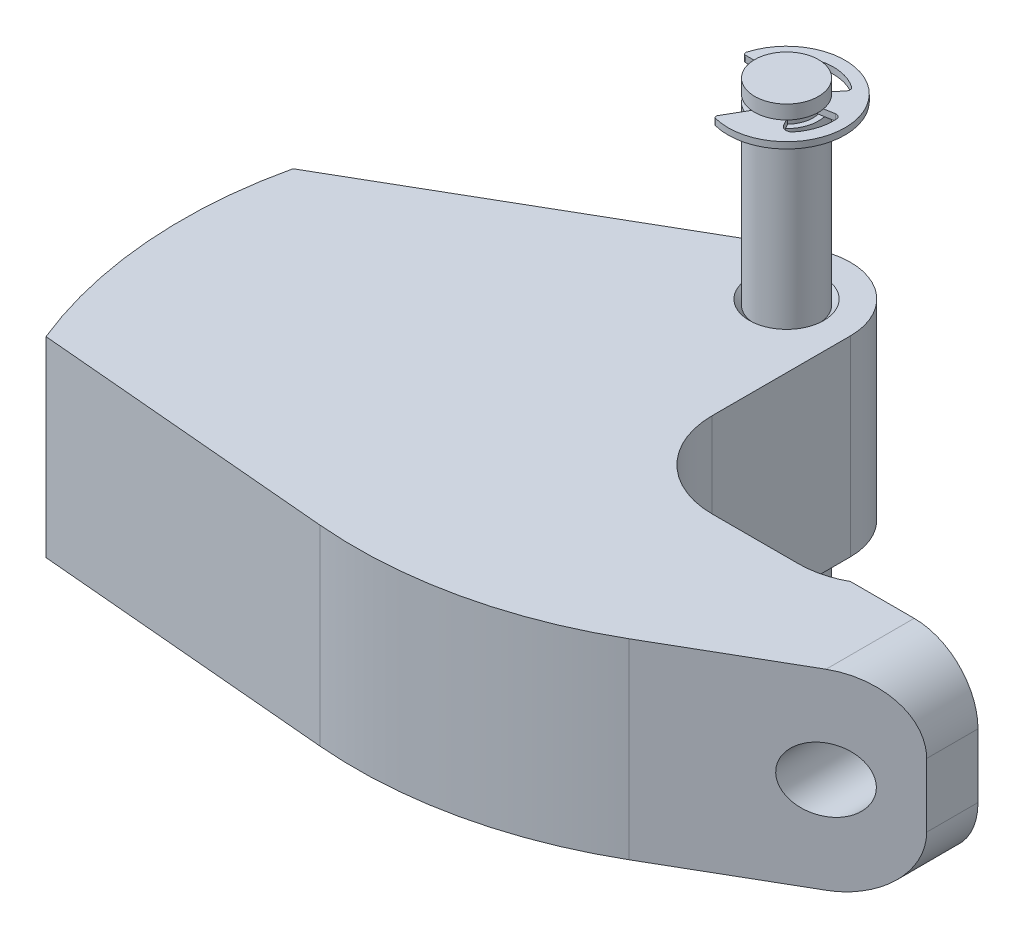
ISO-10303-21;
HEADER;
FILE_DESCRIPTION(('STEP AP214'),'2;1');
FILE_NAME('part.step','',(''),(''),'','','');
FILE_SCHEMA(('AUTOMOTIVE_DESIGN { 1 0 10303 214 1 1 1 1 }'));
ENDSEC;
DATA;
#1=APPLICATION_CONTEXT('core data for automotive mechanical design processes');
#2=APPLICATION_PROTOCOL_DEFINITION('international standard','automotive_design',2000,#1);
#3=PRODUCT_CONTEXT('',#1,'mechanical');
#4=PRODUCT('Part','Part','',(#3));
#5=PRODUCT_RELATED_PRODUCT_CATEGORY('part','',(#4));
#6=PRODUCT_DEFINITION_FORMATION('','',#4);
#7=PRODUCT_DEFINITION_CONTEXT('part definition',#1,'design');
#8=PRODUCT_DEFINITION('design','',#6,#7);
#9=PRODUCT_DEFINITION_SHAPE('','',#8);
#10=(LENGTH_UNIT() NAMED_UNIT(*) SI_UNIT(.MILLI.,.METRE.));
#11=(NAMED_UNIT(*) PLANE_ANGLE_UNIT() SI_UNIT($,.RADIAN.));
#12=(NAMED_UNIT(*) SI_UNIT($,.STERADIAN.) SOLID_ANGLE_UNIT());
#13=UNCERTAINTY_MEASURE_WITH_UNIT(LENGTH_MEASURE(1.E-05),#10,'distance_accuracy_value','');
#14=(GEOMETRIC_REPRESENTATION_CONTEXT(3) GLOBAL_UNCERTAINTY_ASSIGNED_CONTEXT((#13)) GLOBAL_UNIT_ASSIGNED_CONTEXT((#10,
#11,#12)) REPRESENTATION_CONTEXT('',''));
#15=CARTESIAN_POINT('',(0.,0.,0.));
#16=DIRECTION('',(0.,0.,1.));
#17=DIRECTION('',(1.,0.,0.));
#18=AXIS2_PLACEMENT_3D('',#15,#16,#17);
#19=CARTESIAN_POINT('',(0.974620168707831,25.7,-0.56269721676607));
#20=DIRECTION('',(0.,-1.,0.));
#21=DIRECTION('',(-0.866025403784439,0.,0.5));
#22=AXIS2_PLACEMENT_3D('',#19,#20,#21);
#23=PLANE('',#22);
#24=CARTESIAN_POINT('',(0.,25.7,0.));
#25=DIRECTION('',(0.,1.,0.));
#26=DIRECTION('',(-0.866025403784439,0.,0.5));
#27=AXIS2_PLACEMENT_3D('',#24,#25,#26);
#28=CIRCLE('',#27,3.);
#29=CARTESIAN_POINT('',(-0.309362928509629,25.7,2.98400646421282));
#30=VERTEX_POINT('',#29);
#31=CARTESIAN_POINT('',(2.10195467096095,25.7,2.1405108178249));
#32=VERTEX_POINT('',#31);
#33=EDGE_CURVE('E9',#30,#32,#28,.T.);
#34=ORIENTED_EDGE('',*,*,#33,.F.);
#35=DIRECTION('',(0.5,0.,-0.866025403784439));
#36=VECTOR('',#35,1.);
#37=CARTESIAN_POINT('',(-1.47925057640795,25.7,5.01031130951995));
#38=LINE('',#37,#36);
#39=CARTESIAN_POINT('',(-1.47925057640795,25.7,5.01031130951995));
#40=VERTEX_POINT('',#39);
#41=EDGE_CURVE('E884',#40,#30,#38,.T.);
#42=ORIENTED_EDGE('',*,*,#41,.F.);
#43=CARTESIAN_POINT('',(-1.28872498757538,25.7,5.12031130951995));
#44=DIRECTION('',(0.,-1.,0.));
#45=DIRECTION('',(-0.866025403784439,0.,0.5));
#46=AXIS2_PLACEMENT_3D('',#43,#44,#45);
#47=CIRCLE('',#46,0.22);
#48=CARTESIAN_POINT('',(-1.34242186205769,25.7,5.3336576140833));
#49=VERTEX_POINT('',#48);
#50=EDGE_CURVE('E875',#49,#40,#47,.T.);
#51=ORIENTED_EDGE('',*,*,#50,.F.);
#52=CARTESIAN_POINT('',(0.,25.7,0.));
#53=DIRECTION('',(0.,-1.,0.));
#54=DIRECTION('',(-0.866025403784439,0.,0.5));
#55=AXIS2_PLACEMENT_3D('',#52,#53,#54);
#56=CIRCLE('',#55,5.5);
#57=CARTESIAN_POINT('',(-5.29029391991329,25.7,-1.5042573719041));
#58=VERTEX_POINT('',#57);
#59=EDGE_CURVE('E870',#58,#49,#56,.T.);
#60=ORIENTED_EDGE('',*,*,#59,.F.);
#61=CARTESIAN_POINT('',(-5.07868216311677,25.7,-1.44408707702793));
#62=DIRECTION('',(0.,-1.,0.));
#63=DIRECTION('',(-0.866025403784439,0.,0.5));
#64=AXIS2_PLACEMENT_3D('',#61,#62,#63);
#65=CIRCLE('',#64,0.219999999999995);
#66=CARTESIAN_POINT('',(-5.07868216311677,25.7,-1.22408707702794));
#67=VERTEX_POINT('',#66);
#68=EDGE_CURVE('E866',#67,#58,#65,.T.);
#69=ORIENTED_EDGE('',*,*,#68,.F.);
#70=DIRECTION('',(-1.,0.,0.));
#71=VECTOR('',#70,1.);
#72=CARTESIAN_POINT('',(-2.18046275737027,25.7,-1.22408707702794));
#73=LINE('',#72,#71);
#74=CARTESIAN_POINT('',(-2.7389068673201,25.7,-1.22408707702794));
#75=VERTEX_POINT('',#74);
#76=EDGE_CURVE('E865',#75,#67,#73,.T.);
#77=ORIENTED_EDGE('',*,*,#76,.F.);
#78=CARTESIAN_POINT('',(-0.80275940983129,25.7,-2.890601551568));
#79=VERTEX_POINT('',#78);
#80=EDGE_CURVE('E507',#79,#75,#28,.T.);
#81=ORIENTED_EDGE('',*,*,#80,.F.);
#82=DIRECTION('',(0.499848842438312,0.,0.866112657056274));
#83=VECTOR('',#82,1.);
#84=CARTESIAN_POINT('',(-1.1263741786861,25.7,-3.45134476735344));
#85=LINE('',#84,#83);
#86=CARTESIAN_POINT('',(-1.1263741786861,25.7,-3.45134476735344));
#87=VERTEX_POINT('',#86);
#88=EDGE_CURVE('E861',#87,#79,#85,.T.);
#89=ORIENTED_EDGE('',*,*,#88,.F.);
#90=CARTESIAN_POINT('',(-0.606706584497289,25.7,-3.75125407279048));
#91=DIRECTION('',(0.,-1.,0.));
#92=DIRECTION('',(-0.866025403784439,0.,0.5));
#93=AXIS2_PLACEMENT_3D('',#90,#91,#92);
#94=CIRCLE('',#93,0.599999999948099);
#95=CARTESIAN_POINT('',(-0.70250236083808,25.7,-4.34355734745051));
#96=VERTEX_POINT('',#95);
#97=EDGE_CURVE('E851',#96,#87,#94,.F.);
#98=ORIENTED_EDGE('',*,*,#97,.F.);
#99=CARTESIAN_POINT('',(-6.7252974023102E-10,25.7,3.88000395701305E-10));
#100=DIRECTION('',(0.,-1.,0.));
#101=DIRECTION('',(-0.866025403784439,0.,0.5));
#102=AXIS2_PLACEMENT_3D('',#99,#100,#101);
#103=CIRCLE('',#102,4.4);
#104=CARTESIAN_POINT('',(2.47702906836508,25.7,-3.63652677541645));
#105=VERTEX_POINT('',#104);
#106=EDGE_CURVE('E846',#105,#96,#103,.F.);
#107=ORIENTED_EDGE('',*,*,#106,.F.);
#108=CARTESIAN_POINT('',(2.25184460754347,25.7,-3.3059334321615));
#109=DIRECTION('',(0.,-1.,0.));
#110=DIRECTION('',(-0.866025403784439,0.,0.5));
#111=AXIS2_PLACEMENT_3D('',#108,#109,#110);
#112=CIRCLE('',#111,0.4);
#113=CARTESIAN_POINT('',(2.55826238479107,25.7,-3.04881838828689));
#114=VERTEX_POINT('',#113);
#115=EDGE_CURVE('E842',#114,#105,#112,.F.);
#116=ORIENTED_EDGE('',*,*,#115,.F.);
#117=DIRECTION('',(0.642787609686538,0.,-0.76604444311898));
#118=VECTOR('',#117,1.);
#119=CARTESIAN_POINT('',(1.60696902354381,25.7,-1.91511110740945));
#120=LINE('',#119,#118);
#121=CARTESIAN_POINT('',(1.92836282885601,25.7,-2.29813332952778));
#122=VERTEX_POINT('',#121);
#123=EDGE_CURVE('E973',#122,#114,#120,.T.);
#124=ORIENTED_EDGE('',*,*,#123,.F.);
#125=CARTESIAN_POINT('',(2.95442325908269,25.7,-0.520944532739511));
#126=VERTEX_POINT('',#125);
#127=EDGE_CURVE('E26',#126,#122,#28,.T.);
#128=ORIENTED_EDGE('',*,*,#127,.F.);
#129=DIRECTION('',(-0.984807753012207,0.,0.173648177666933));
#130=VECTOR('',#129,1.);
#131=CARTESIAN_POINT('',(3.91948536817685,25.7,-0.69111102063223));
#132=LINE('',#131,#130);
#133=CARTESIAN_POINT('',(3.91948536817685,25.7,-0.69111102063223));
#134=VERTEX_POINT('',#133);
#135=EDGE_CURVE('E969',#134,#126,#132,.T.);
#136=ORIENTED_EDGE('',*,*,#135,.F.);
#137=CARTESIAN_POINT('',(3.98894463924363,25.7,-0.297187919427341));
#138=DIRECTION('',(0.,-1.,0.));
#139=DIRECTION('',(-0.866025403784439,0.,0.5));
#140=AXIS2_PLACEMENT_3D('',#137,#138,#139);
#141=CIRCLE('',#140,0.4);
#142=CARTESIAN_POINT('',(4.38783910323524,25.7,-0.326906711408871));
#143=VERTEX_POINT('',#142);
#144=EDGE_CURVE('E837',#143,#134,#141,.F.);
#145=ORIENTED_EDGE('',*,*,#144,.F.);
#146=CARTESIAN_POINT('',(-6.7252974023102E-10,25.7,3.88000395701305E-10));
#147=DIRECTION('',(0.,-1.,0.));
#148=DIRECTION('',(-0.866025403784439,0.,0.5));
#149=AXIS2_PLACEMENT_3D('',#146,#147,#148);
#150=CIRCLE('',#149,4.4);
#151=CARTESIAN_POINT('',(3.41037982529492,25.7,2.78016356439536));
#152=VERTEX_POINT('',#151);
#153=EDGE_CURVE('E833',#152,#143,#150,.F.);
#154=ORIENTED_EDGE('',*,*,#153,.F.);
#155=CARTESIAN_POINT('',(2.94532803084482,25.7,2.40105035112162));
#156=DIRECTION('',(0.,-1.,0.));
#157=DIRECTION('',(-0.866025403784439,0.,0.5));
#158=AXIS2_PLACEMENT_3D('',#155,#156,#157);
#159=CIRCLE('',#158,0.6);
#160=CARTESIAN_POINT('',(2.42576515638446,25.7,2.7011410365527));
#161=VERTEX_POINT('',#160);
#162=EDGE_CURVE('E829',#161,#152,#159,.F.);
#163=ORIENTED_EDGE('',*,*,#162,.F.);
#164=DIRECTION('',(0.500151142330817,0.,0.86593812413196));
#165=VECTOR('',#164,1.);
#166=CARTESIAN_POINT('',(1.94012260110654,25.7,1.8603223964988));
#167=LINE('',#166,#165);
#168=EDGE_CURVE('E827',#32,#161,#167,.T.);
#169=ORIENTED_EDGE('',*,*,#168,.F.);
#170=EDGE_LOOP('',(#34,#42,#51,#60,#69,#77,#81,#89,#98,#107,#116,#124,#128,#136,#145,#154,#163,#169));
#171=FACE_BOUND('',#170,.T.);
#172=ADVANCED_FACE('F15',(#171),#23,.F.);
#173=CARTESIAN_POINT('',(0.974620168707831,25.1,-0.56269721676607));
#174=DIRECTION('',(0.,-1.,0.));
#175=DIRECTION('',(-0.866025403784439,0.,0.5));
#176=AXIS2_PLACEMENT_3D('',#173,#174,#175);
#177=PLANE('',#176);
#178=CARTESIAN_POINT('',(0.,25.1,0.));
#179=DIRECTION('',(0.,-1.,0.));
#180=DIRECTION('',(-0.866025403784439,0.,0.5));
#181=AXIS2_PLACEMENT_3D('',#178,#179,#180);
#182=CIRCLE('',#181,5.5);
#183=CARTESIAN_POINT('',(-1.34242186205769,25.1,5.3336576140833));
#184=VERTEX_POINT('',#183);
#185=CARTESIAN_POINT('',(-5.29029391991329,25.1,-1.5042573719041));
#186=VERTEX_POINT('',#185);
#187=EDGE_CURVE('E813',#184,#186,#182,.F.);
#188=ORIENTED_EDGE('',*,*,#187,.F.);
#189=CARTESIAN_POINT('',(-1.28872498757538,25.1,5.12031130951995));
#190=DIRECTION('',(0.,-1.,0.));
#191=DIRECTION('',(-0.866025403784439,0.,0.5));
#192=AXIS2_PLACEMENT_3D('',#189,#190,#191);
#193=CIRCLE('',#192,0.22);
#194=CARTESIAN_POINT('',(-1.47925057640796,25.1,5.01031130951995));
#195=VERTEX_POINT('',#194);
#196=EDGE_CURVE('E817',#195,#184,#193,.F.);
#197=ORIENTED_EDGE('',*,*,#196,.F.);
#198=DIRECTION('',(-0.5,0.,0.866025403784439));
#199=VECTOR('',#198,1.);
#200=CARTESIAN_POINT('',(-0.0301408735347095,25.1,2.50037967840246));
#201=LINE('',#200,#199);
#202=CARTESIAN_POINT('',(-0.0301408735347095,25.1,2.50037967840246));
#203=VERTEX_POINT('',#202);
#204=EDGE_CURVE('E905',#203,#195,#201,.T.);
#205=ORIENTED_EDGE('',*,*,#204,.F.);
#206=DIRECTION('',(-0.866025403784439,0.,0.5));
#207=VECTOR('',#206,1.);
#208=CARTESIAN_POINT('',(2.04978111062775,25.1,1.29953616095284));
#209=LINE('',#208,#207);
#210=CARTESIAN_POINT('',(-0.0291769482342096,25.1,2.49982708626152));
#211=VERTEX_POINT('',#210);
#212=EDGE_CURVE('E740',#203,#211,#209,.F.);
#213=ORIENTED_EDGE('',*,*,#212,.T.);
#214=CARTESIAN_POINT('',(-4.39752401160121E-13,25.1,0.));
#215=DIRECTION('',(0.,-1.,0.));
#216=DIRECTION('',(-0.866025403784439,0.,0.5));
#217=AXIS2_PLACEMENT_3D('',#214,#215,#216);
#218=CIRCLE('',#217,2.5);
#219=CARTESIAN_POINT('',(1.70776592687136,25.1,1.8257972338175));
#220=VERTEX_POINT('',#219);
#221=EDGE_CURVE('E744',#211,#220,#218,.F.);
#222=ORIENTED_EDGE('',*,*,#221,.T.);
#223=CARTESIAN_POINT('',(1.81023188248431,25.1,1.9353450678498));
#224=DIRECTION('',(0.,-1.,0.));
#225=DIRECTION('',(-0.866025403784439,0.,0.5));
#226=AXIS2_PLACEMENT_3D('',#223,#224,#225);
#227=CIRCLE('',#226,0.150000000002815);
#228=CARTESIAN_POINT('',(1.94012260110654,25.1,1.86032239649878));
#229=VERTEX_POINT('',#228);
#230=EDGE_CURVE('E748',#229,#220,#227,.F.);
#231=ORIENTED_EDGE('',*,*,#230,.F.);
#232=DIRECTION('',(-0.500151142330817,0.,-0.865938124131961));
#233=VECTOR('',#232,1.);
#234=CARTESIAN_POINT('',(2.42576515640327,25.1,2.70114103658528));
#235=LINE('',#234,#233);
#236=CARTESIAN_POINT('',(2.42576515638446,25.1,2.7011410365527));
#237=VERTEX_POINT('',#236);
#238=EDGE_CURVE('E885',#237,#229,#235,.T.);
#239=ORIENTED_EDGE('',*,*,#238,.F.);
#240=CARTESIAN_POINT('',(2.94532803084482,25.1,2.40105035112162));
#241=DIRECTION('',(0.,-1.,0.));
#242=DIRECTION('',(-0.866025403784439,0.,0.5));
#243=AXIS2_PLACEMENT_3D('',#240,#241,#242);
#244=CIRCLE('',#243,0.6);
#245=CARTESIAN_POINT('',(3.41037982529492,25.1,2.78016356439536));
#246=VERTEX_POINT('',#245);
#247=EDGE_CURVE('E753',#237,#246,#244,.F.);
#248=ORIENTED_EDGE('',*,*,#247,.T.);
#249=CARTESIAN_POINT('',(-6.72539281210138E-10,25.1,3.88000395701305E-10));
#250=DIRECTION('',(0.,-1.,0.));
#251=DIRECTION('',(-0.866025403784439,0.,0.5));
#252=AXIS2_PLACEMENT_3D('',#249,#250,#251);
#253=CIRCLE('',#252,4.4);
#254=CARTESIAN_POINT('',(4.38783910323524,25.1,-0.326906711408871));
#255=VERTEX_POINT('',#254);
#256=EDGE_CURVE('E759',#246,#255,#253,.F.);
#257=ORIENTED_EDGE('',*,*,#256,.T.);
#258=CARTESIAN_POINT('',(3.98894463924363,25.1,-0.297187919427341));
#259=DIRECTION('',(0.,-1.,0.));
#260=DIRECTION('',(-0.866025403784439,0.,0.5));
#261=AXIS2_PLACEMENT_3D('',#258,#259,#260);
#262=CIRCLE('',#261,0.4);
#263=CARTESIAN_POINT('',(3.91948536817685,25.1,-0.691111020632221));
#264=VERTEX_POINT('',#263);
#265=EDGE_CURVE('E764',#255,#264,#262,.F.);
#266=ORIENTED_EDGE('',*,*,#265,.T.);
#267=DIRECTION('',(0.984807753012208,0.,-0.17364817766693));
#268=VECTOR('',#267,1.);
#269=CARTESIAN_POINT('',(2.46201938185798,25.1,-0.43412044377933));
#270=LINE('',#269,#268);
#271=CARTESIAN_POINT('',(2.46201938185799,25.1,-0.43412044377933));
#272=VERTEX_POINT('',#271);
#273=EDGE_CURVE('E768',#272,#264,#270,.T.);
#274=ORIENTED_EDGE('',*,*,#273,.F.);
#275=CARTESIAN_POINT('',(-6.7252974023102E-10,25.1,3.88000395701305E-10));
#276=DIRECTION('',(0.,-1.,0.));
#277=DIRECTION('',(-0.866025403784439,0.,0.5));
#278=AXIS2_PLACEMENT_3D('',#275,#276,#277);
#279=CIRCLE('',#278,2.5);
#280=CARTESIAN_POINT('',(1.60696902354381,25.1,-1.91511110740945));
#281=VERTEX_POINT('',#280);
#282=EDGE_CURVE('E769',#272,#281,#279,.F.);
#283=ORIENTED_EDGE('',*,*,#282,.T.);
#284=DIRECTION('',(-0.642787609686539,0.,0.766044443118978));
#285=VECTOR('',#284,1.);
#286=CARTESIAN_POINT('',(2.55826238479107,25.1,-3.04881838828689));
#287=LINE('',#286,#285);
#288=CARTESIAN_POINT('',(2.55826238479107,25.1,-3.04881838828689));
#289=VERTEX_POINT('',#288);
#290=EDGE_CURVE('E773',#289,#281,#287,.T.);
#291=ORIENTED_EDGE('',*,*,#290,.F.);
#292=CARTESIAN_POINT('',(2.25184460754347,25.1,-3.3059334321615));
#293=DIRECTION('',(0.,-1.,0.));
#294=DIRECTION('',(-0.866025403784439,0.,0.5));
#295=AXIS2_PLACEMENT_3D('',#292,#293,#294);
#296=CIRCLE('',#295,0.4);
#297=CARTESIAN_POINT('',(2.47702906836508,25.1,-3.63652677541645));
#298=VERTEX_POINT('',#297);
#299=EDGE_CURVE('E775',#289,#298,#296,.F.);
#300=ORIENTED_EDGE('',*,*,#299,.T.);
#301=CARTESIAN_POINT('',(-6.72539281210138E-10,25.1,3.88000395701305E-10));
#302=DIRECTION('',(0.,-1.,0.));
#303=DIRECTION('',(-0.866025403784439,0.,0.5));
#304=AXIS2_PLACEMENT_3D('',#301,#302,#303);
#305=CIRCLE('',#304,4.4);
#306=CARTESIAN_POINT('',(-0.70250236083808,25.1,-4.34355734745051));
#307=VERTEX_POINT('',#306);
#308=EDGE_CURVE('E781',#298,#307,#305,.F.);
#309=ORIENTED_EDGE('',*,*,#308,.T.);
#310=CARTESIAN_POINT('',(-0.606706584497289,25.1,-3.75125407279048));
#311=DIRECTION('',(0.,-1.,0.));
#312=DIRECTION('',(-0.866025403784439,0.,0.5));
#313=AXIS2_PLACEMENT_3D('',#310,#311,#312);
#314=CIRCLE('',#313,0.599999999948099);
#315=CARTESIAN_POINT('',(-1.1263741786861,25.1,-3.45134476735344));
#316=VERTEX_POINT('',#315);
#317=EDGE_CURVE('E786',#307,#316,#314,.F.);
#318=ORIENTED_EDGE('',*,*,#317,.T.);
#319=DIRECTION('',(-0.499848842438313,0.,-0.866112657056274));
#320=VECTOR('',#319,1.);
#321=CARTESIAN_POINT('',(-0.64102515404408,25.1,-2.61035665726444));
#322=LINE('',#321,#320);
#323=CARTESIAN_POINT('',(-0.6410251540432,25.1,-2.6103566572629));
#324=VERTEX_POINT('',#323);
#325=EDGE_CURVE('E790',#324,#316,#322,.T.);
#326=ORIENTED_EDGE('',*,*,#325,.F.);
#327=CARTESIAN_POINT('',(-0.770942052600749,25.1,-2.53537933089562));
#328=DIRECTION('',(0.,-1.,0.));
#329=DIRECTION('',(-0.866025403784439,0.,0.5));
#330=AXIS2_PLACEMENT_3D('',#327,#328,#329);
#331=CIRCLE('',#330,0.15);
#332=CARTESIAN_POINT('',(-0.72730382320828,25.1,-2.39186729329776));
#333=VERTEX_POINT('',#332);
#334=EDGE_CURVE('E791',#333,#324,#331,.F.);
#335=ORIENTED_EDGE('',*,*,#334,.F.);
#336=CARTESIAN_POINT('',(-4.70110061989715E-13,25.1,0.));
#337=DIRECTION('',(0.,-1.,0.));
#338=DIRECTION('',(-0.866025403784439,0.,0.5));
#339=AXIS2_PLACEMENT_3D('',#336,#337,#338);
#340=CIRCLE('',#339,2.5);
#341=CARTESIAN_POINT('',(-2.17950377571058,25.1,-1.22464823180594));
#342=VERTEX_POINT('',#341);
#343=EDGE_CURVE('E797',#333,#342,#340,.F.);
#344=ORIENTED_EDGE('',*,*,#343,.T.);
#345=DIRECTION('',(0.863093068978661,0.,-0.505044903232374));
#346=VECTOR('',#345,1.);
#347=CARTESIAN_POINT('',(-2.18046275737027,25.1,-1.22408707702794));
#348=LINE('',#347,#346);
#349=CARTESIAN_POINT('',(-2.18046275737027,25.1,-1.22408707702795));
#350=VERTEX_POINT('',#349);
#351=EDGE_CURVE('E801',#350,#342,#348,.T.);
#352=ORIENTED_EDGE('',*,*,#351,.F.);
#353=DIRECTION('',(1.,0.,0.));
#354=VECTOR('',#353,1.);
#355=CARTESIAN_POINT('',(-5.07868216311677,25.1,-1.22408707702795));
#356=LINE('',#355,#354);
#357=CARTESIAN_POINT('',(-5.07868216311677,25.1,-1.22408707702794));
#358=VERTEX_POINT('',#357);
#359=EDGE_CURVE('E901',#358,#350,#356,.T.);
#360=ORIENTED_EDGE('',*,*,#359,.F.);
#361=CARTESIAN_POINT('',(-5.07868216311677,25.1,-1.44408707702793));
#362=DIRECTION('',(0.,-1.,0.));
#363=DIRECTION('',(-0.866025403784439,0.,0.5));
#364=AXIS2_PLACEMENT_3D('',#361,#362,#363);
#365=CIRCLE('',#364,0.219999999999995);
#366=EDGE_CURVE('E807',#186,#358,#365,.F.);
#367=ORIENTED_EDGE('',*,*,#366,.F.);
#368=EDGE_LOOP('',(#188,#197,#205,#213,#222,#231,#239,#248,#257,#266,#274,#283,#291,#300,#309,
#318,#326,#335,#344,#352,#360,#367));
#369=FACE_BOUND('',#368,.T.);
#370=ADVANCED_FACE('F1202',(#369),#177,.T.);
#371=CARTESIAN_POINT('',(1.81023188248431,25.7,1.9353450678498));
#372=DIRECTION('',(0.,-1.,0.));
#373=DIRECTION('',(-0.866025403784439,0.,0.5));
#374=AXIS2_PLACEMENT_3D('',#371,#372,#373);
#375=CYLINDRICAL_SURFACE('',#374,0.150000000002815);
#376=CARTESIAN_POINT('',(1.81023188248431,25.7,1.9353450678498));
#377=DIRECTION('',(0.,-1.,0.));
#378=DIRECTION('',(-0.866025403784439,0.,0.5));
#379=AXIS2_PLACEMENT_3D('',#376,#377,#378);
#380=CIRCLE('',#379,0.150000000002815);
#381=CARTESIAN_POINT('',(1.70776592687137,25.7,1.8257972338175));
#382=VERTEX_POINT('',#381);
#383=CARTESIAN_POINT('',(1.94012260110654,25.7,1.86032239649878));
#384=VERTEX_POINT('',#383);
#385=EDGE_CURVE('E823',#382,#384,#380,.T.);
#386=ORIENTED_EDGE('',*,*,#385,.T.);
#387=DIRECTION('',(0.,1.,0.));
#388=VECTOR('',#387,1.);
#389=CARTESIAN_POINT('',(1.94012260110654,25.7,1.8603223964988));
#390=LINE('',#389,#388);
#391=EDGE_CURVE('E889',#229,#384,#390,.T.);
#392=ORIENTED_EDGE('',*,*,#391,.F.);
#393=ORIENTED_EDGE('',*,*,#230,.T.);
#394=DIRECTION('',(0.,-1.,0.));
#395=VECTOR('',#394,1.);
#396=CARTESIAN_POINT('',(1.70776592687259,25.7,1.82579723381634));
#397=LINE('',#396,#395);
#398=EDGE_CURVE('E752',#220,#382,#397,.F.);
#399=ORIENTED_EDGE('',*,*,#398,.T.);
#400=EDGE_LOOP('',(#386,#392,#393,#399));
#401=FACE_BOUND('',#400,.T.);
#402=ADVANCED_FACE('F1752',(#401),#375,.T.);
#403=CARTESIAN_POINT('',(2.42576515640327,25.7,2.70114103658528));
#404=DIRECTION('',(0.865938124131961,0.,-0.500151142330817));
#405=DIRECTION('',(-0.500151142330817,0.,-0.865938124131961));
#406=AXIS2_PLACEMENT_3D('',#403,#404,#405);
#407=PLANE('',#406);
#408=EDGE_CURVE('E36',#384,#32,#167,.T.);
#409=ORIENTED_EDGE('',*,*,#408,.T.);
#410=ORIENTED_EDGE('',*,*,#168,.T.);
#411=DIRECTION('',(0.,-1.,0.));
#412=VECTOR('',#411,1.);
#413=CARTESIAN_POINT('',(2.42576515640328,25.7,2.70114103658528));
#414=LINE('',#413,#412);
#415=EDGE_CURVE('E758',#161,#237,#414,.T.);
#416=ORIENTED_EDGE('',*,*,#415,.T.);
#417=ORIENTED_EDGE('',*,*,#238,.T.);
#418=ORIENTED_EDGE('',*,*,#391,.T.);
#419=EDGE_LOOP('',(#409,#410,#416,#417,#418));
#420=FACE_BOUND('',#419,.T.);
#421=ADVANCED_FACE('F1051',(#420),#407,.T.);
#422=CARTESIAN_POINT('',(2.94532803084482,25.7,2.40105035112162));
#423=DIRECTION('',(0.,-1.,0.));
#424=DIRECTION('',(-0.866025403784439,0.,0.5));
#425=AXIS2_PLACEMENT_3D('',#422,#423,#424);
#426=CYLINDRICAL_SURFACE('',#425,0.6);
#427=ORIENTED_EDGE('',*,*,#415,.F.);
#428=ORIENTED_EDGE('',*,*,#162,.T.);
#429=DIRECTION('',(0.,-1.,0.));
#430=VECTOR('',#429,1.);
#431=CARTESIAN_POINT('',(3.41037982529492,25.7,2.78016356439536));
#432=LINE('',#431,#430);
#433=EDGE_CURVE('E757',#152,#246,#432,.T.);
#434=ORIENTED_EDGE('',*,*,#433,.T.);
#435=ORIENTED_EDGE('',*,*,#247,.F.);
#436=EDGE_LOOP('',(#427,#428,#434,#435));
#437=FACE_BOUND('',#436,.T.);
#438=ADVANCED_FACE('F1061',(#437),#426,.F.);
#439=CARTESIAN_POINT('',(-6.7252974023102E-10,25.7,3.88000395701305E-10));
#440=DIRECTION('',(0.,-1.,0.));
#441=DIRECTION('',(-0.866025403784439,0.,0.5));
#442=AXIS2_PLACEMENT_3D('',#439,#440,#441);
#443=CYLINDRICAL_SURFACE('',#442,4.4);
#444=ORIENTED_EDGE('',*,*,#433,.F.);
#445=ORIENTED_EDGE('',*,*,#153,.T.);
#446=DIRECTION('',(0.,-1.,0.));
#447=VECTOR('',#446,1.);
#448=CARTESIAN_POINT('',(4.38783910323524,25.7,-0.326906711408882));
#449=LINE('',#448,#447);
#450=EDGE_CURVE('E763',#143,#255,#449,.T.);
#451=ORIENTED_EDGE('',*,*,#450,.T.);
#452=ORIENTED_EDGE('',*,*,#256,.F.);
#453=EDGE_LOOP('',(#444,#445,#451,#452));
#454=FACE_BOUND('',#453,.T.);
#455=ADVANCED_FACE('F1069',(#454),#443,.F.);
#456=CARTESIAN_POINT('',(3.98894463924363,25.7,-0.297187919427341));
#457=DIRECTION('',(0.,-1.,0.));
#458=DIRECTION('',(-0.866025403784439,0.,0.5));
#459=AXIS2_PLACEMENT_3D('',#456,#457,#458);
#460=CYLINDRICAL_SURFACE('',#459,0.4);
#461=ORIENTED_EDGE('',*,*,#450,.F.);
#462=ORIENTED_EDGE('',*,*,#144,.T.);
#463=DIRECTION('',(0.,1.,0.));
#464=VECTOR('',#463,1.);
#465=CARTESIAN_POINT('',(3.91948536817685,25.7,-0.691111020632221));
#466=LINE('',#465,#464);
#467=EDGE_CURVE('E893',#264,#134,#466,.T.);
#468=ORIENTED_EDGE('',*,*,#467,.F.);
#469=ORIENTED_EDGE('',*,*,#265,.F.);
#470=EDGE_LOOP('',(#461,#462,#468,#469));
#471=FACE_BOUND('',#470,.T.);
#472=ADVANCED_FACE('F1204',(#471),#460,.F.);
#473=CARTESIAN_POINT('',(2.46201938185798,25.7,-0.43412044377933));
#474=DIRECTION('',(0.17364817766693,0.,0.984807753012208));
#475=DIRECTION('',(0.984807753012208,0.,-0.17364817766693));
#476=AXIS2_PLACEMENT_3D('',#473,#474,#475);
#477=PLANE('',#476);
#478=ORIENTED_EDGE('',*,*,#135,.T.);
#479=CARTESIAN_POINT('',(2.46201938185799,25.7,-0.43412044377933));
#480=VERTEX_POINT('',#479);
#481=EDGE_CURVE('E841',#126,#480,#132,.T.);
#482=ORIENTED_EDGE('',*,*,#481,.T.);
#483=DIRECTION('',(0.,-1.,0.));
#484=VECTOR('',#483,1.);
#485=CARTESIAN_POINT('',(2.46201938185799,25.7,-0.434120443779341));
#486=LINE('',#485,#484);
#487=EDGE_CURVE('E774',#480,#272,#486,.T.);
#488=ORIENTED_EDGE('',*,*,#487,.T.);
#489=ORIENTED_EDGE('',*,*,#273,.T.);
#490=ORIENTED_EDGE('',*,*,#467,.T.);
#491=EDGE_LOOP('',(#478,#482,#488,#489,#490));
#492=FACE_BOUND('',#491,.T.);
#493=ADVANCED_FACE('F1175',(#492),#477,.T.);
#494=CARTESIAN_POINT('',(2.55826238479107,25.7,-3.04881838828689));
#495=DIRECTION('',(-0.766044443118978,0.,-0.642787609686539));
#496=DIRECTION('',(-0.642787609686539,0.,0.766044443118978));
#497=AXIS2_PLACEMENT_3D('',#494,#495,#496);
#498=PLANE('',#497);
#499=CARTESIAN_POINT('',(1.60696902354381,25.7,-1.91511110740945));
#500=VERTEX_POINT('',#499);
#501=EDGE_CURVE('E847',#500,#122,#120,.T.);
#502=ORIENTED_EDGE('',*,*,#501,.T.);
#503=ORIENTED_EDGE('',*,*,#123,.T.);
#504=DIRECTION('',(0.,-1.,0.));
#505=VECTOR('',#504,1.);
#506=CARTESIAN_POINT('',(2.55826238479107,25.7,-3.04881838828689));
#507=LINE('',#506,#505);
#508=EDGE_CURVE('E780',#114,#289,#507,.T.);
#509=ORIENTED_EDGE('',*,*,#508,.T.);
#510=ORIENTED_EDGE('',*,*,#290,.T.);
#511=DIRECTION('',(0.,1.,0.));
#512=VECTOR('',#511,1.);
#513=CARTESIAN_POINT('',(1.60696902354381,25.7,-1.91511110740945));
#514=LINE('',#513,#512);
#515=EDGE_CURVE('E897',#281,#500,#514,.T.);
#516=ORIENTED_EDGE('',*,*,#515,.T.);
#517=EDGE_LOOP('',(#502,#503,#509,#510,#516));
#518=FACE_BOUND('',#517,.T.);
#519=ADVANCED_FACE('F1132',(#518),#498,.T.);
#520=CARTESIAN_POINT('',(2.25184460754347,25.7,-3.3059334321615));
#521=DIRECTION('',(0.,-1.,0.));
#522=DIRECTION('',(-0.866025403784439,0.,0.5));
#523=AXIS2_PLACEMENT_3D('',#520,#521,#522);
#524=CYLINDRICAL_SURFACE('',#523,0.4);
#525=ORIENTED_EDGE('',*,*,#508,.F.);
#526=ORIENTED_EDGE('',*,*,#115,.T.);
#527=DIRECTION('',(0.,-1.,0.));
#528=VECTOR('',#527,1.);
#529=CARTESIAN_POINT('',(2.47702906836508,25.7,-3.63652677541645));
#530=LINE('',#529,#528);
#531=EDGE_CURVE('E779',#105,#298,#530,.T.);
#532=ORIENTED_EDGE('',*,*,#531,.T.);
#533=ORIENTED_EDGE('',*,*,#299,.F.);
#534=EDGE_LOOP('',(#525,#526,#532,#533));
#535=FACE_BOUND('',#534,.T.);
#536=ADVANCED_FACE('F1160',(#535),#524,.F.);
#537=CARTESIAN_POINT('',(-6.7252974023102E-10,25.7,3.88000395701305E-10));
#538=DIRECTION('',(0.,-1.,0.));
#539=DIRECTION('',(-0.866025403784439,0.,0.5));
#540=AXIS2_PLACEMENT_3D('',#537,#538,#539);
#541=CYLINDRICAL_SURFACE('',#540,4.4);
#542=ORIENTED_EDGE('',*,*,#531,.F.);
#543=ORIENTED_EDGE('',*,*,#106,.T.);
#544=DIRECTION('',(0.,-1.,0.));
#545=VECTOR('',#544,1.);
#546=CARTESIAN_POINT('',(-0.702502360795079,25.7,-4.34355734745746));
#547=LINE('',#546,#545);
#548=EDGE_CURVE('E785',#96,#307,#547,.T.);
#549=ORIENTED_EDGE('',*,*,#548,.T.);
#550=ORIENTED_EDGE('',*,*,#308,.F.);
#551=EDGE_LOOP('',(#542,#543,#549,#550));
#552=FACE_BOUND('',#551,.T.);
#553=ADVANCED_FACE('F1199',(#552),#541,.F.);
#554=CARTESIAN_POINT('',(-0.606706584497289,25.7,-3.75125407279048));
#555=DIRECTION('',(0.,-1.,0.));
#556=DIRECTION('',(-0.866025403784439,0.,0.5));
#557=AXIS2_PLACEMENT_3D('',#554,#555,#556);
#558=CYLINDRICAL_SURFACE('',#557,0.599999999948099);
#559=ORIENTED_EDGE('',*,*,#548,.F.);
#560=ORIENTED_EDGE('',*,*,#97,.T.);
#561=DIRECTION('',(0.,1.,0.));
#562=VECTOR('',#561,1.);
#563=CARTESIAN_POINT('',(-1.1263741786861,25.7,-3.45134476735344));
#564=LINE('',#563,#562);
#565=EDGE_CURVE('E796',#316,#87,#564,.T.);
#566=ORIENTED_EDGE('',*,*,#565,.F.);
#567=ORIENTED_EDGE('',*,*,#317,.F.);
#568=EDGE_LOOP('',(#559,#560,#566,#567));
#569=FACE_BOUND('',#568,.T.);
#570=ADVANCED_FACE('F1197',(#569),#558,.F.);
#571=CARTESIAN_POINT('',(-0.64102515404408,25.7,-2.61035665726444));
#572=DIRECTION('',(0.866112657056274,0.,-0.499848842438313));
#573=DIRECTION('',(-0.499848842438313,0.,-0.866112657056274));
#574=AXIS2_PLACEMENT_3D('',#571,#572,#573);
#575=PLANE('',#574);
#576=ORIENTED_EDGE('',*,*,#88,.T.);
#577=CARTESIAN_POINT('',(-0.64102515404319,25.7,-2.6103566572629));
#578=VERTEX_POINT('',#577);
#579=EDGE_CURVE('E855',#79,#578,#85,.T.);
#580=ORIENTED_EDGE('',*,*,#579,.T.);
#581=DIRECTION('',(0.,-1.,0.));
#582=VECTOR('',#581,1.);
#583=CARTESIAN_POINT('',(-0.64102515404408,25.7,-2.61035665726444));
#584=LINE('',#583,#582);
#585=EDGE_CURVE('E795',#324,#578,#584,.F.);
#586=ORIENTED_EDGE('',*,*,#585,.F.);
#587=ORIENTED_EDGE('',*,*,#325,.T.);
#588=ORIENTED_EDGE('',*,*,#565,.T.);
#589=EDGE_LOOP('',(#576,#580,#586,#587,#588));
#590=FACE_BOUND('',#589,.T.);
#591=ADVANCED_FACE('F1191',(#590),#575,.T.);
#592=CARTESIAN_POINT('',(-0.770942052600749,25.7,-2.53537933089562));
#593=DIRECTION('',(0.,-1.,0.));
#594=DIRECTION('',(-0.866025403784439,0.,0.5));
#595=AXIS2_PLACEMENT_3D('',#592,#593,#594);
#596=CYLINDRICAL_SURFACE('',#595,0.15);
#597=CARTESIAN_POINT('',(-0.770942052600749,25.7,-2.53537933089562));
#598=DIRECTION('',(0.,-1.,0.));
#599=DIRECTION('',(-0.866025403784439,0.,0.5));
#600=AXIS2_PLACEMENT_3D('',#597,#598,#599);
#601=CIRCLE('',#600,0.15);
#602=CARTESIAN_POINT('',(-0.72730382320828,25.7,-2.39186729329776));
#603=VERTEX_POINT('',#602);
#604=EDGE_CURVE('E856',#578,#603,#601,.T.);
#605=ORIENTED_EDGE('',*,*,#604,.T.);
#606=DIRECTION('',(0.,-1.,0.));
#607=VECTOR('',#606,1.);
#608=CARTESIAN_POINT('',(-0.72730382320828,25.7,-2.39186729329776));
#609=LINE('',#608,#607);
#610=EDGE_CURVE('E802',#603,#333,#609,.T.);
#611=ORIENTED_EDGE('',*,*,#610,.T.);
#612=ORIENTED_EDGE('',*,*,#334,.T.);
#613=ORIENTED_EDGE('',*,*,#585,.T.);
#614=EDGE_LOOP('',(#605,#611,#612,#613));
#615=FACE_BOUND('',#614,.T.);
#616=ADVANCED_FACE('F1186',(#615),#596,.T.);
#617=CARTESIAN_POINT('',(-2.18046275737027,25.7,-1.22408707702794));
#618=DIRECTION('',(0.505044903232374,0.,0.863093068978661));
#619=DIRECTION('',(0.863093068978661,0.,-0.505044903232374));
#620=AXIS2_PLACEMENT_3D('',#617,#618,#619);
#621=PLANE('',#620);
#622=DIRECTION('',(0.863093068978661,0.,-0.505044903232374));
#623=VECTOR('',#622,1.);
#624=CARTESIAN_POINT('',(-2.18046275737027,25.7,-1.22408707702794));
#625=LINE('',#624,#623);
#626=CARTESIAN_POINT('',(-2.17950377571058,25.7,-1.22464823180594));
#627=VERTEX_POINT('',#626);
#628=CARTESIAN_POINT('',(-2.18046275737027,25.7,-1.22408707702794));
#629=VERTEX_POINT('',#628);
#630=EDGE_CURVE('E860',#627,#629,#625,.F.);
#631=ORIENTED_EDGE('',*,*,#630,.T.);
#632=DIRECTION('',(0.,1.,0.));
#633=VECTOR('',#632,1.);
#634=CARTESIAN_POINT('',(-2.18046275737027,25.7,-1.22408707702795));
#635=LINE('',#634,#633);
#636=EDGE_CURVE('E812',#350,#629,#635,.T.);
#637=ORIENTED_EDGE('',*,*,#636,.F.);
#638=ORIENTED_EDGE('',*,*,#351,.T.);
#639=DIRECTION('',(0.,1.,0.));
#640=VECTOR('',#639,1.);
#641=CARTESIAN_POINT('',(-2.17950377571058,25.7,-1.22464823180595));
#642=LINE('',#641,#640);
#643=EDGE_CURVE('E806',#342,#627,#642,.T.);
#644=ORIENTED_EDGE('',*,*,#643,.T.);
#645=EDGE_LOOP('',(#631,#637,#638,#644));
#646=FACE_BOUND('',#645,.T.);
#647=ADVANCED_FACE('F998',(#646),#621,.T.);
#648=CARTESIAN_POINT('',(-5.07868216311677,25.7,-1.22408707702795));
#649=DIRECTION('',(0.,0.,1.));
#650=DIRECTION('',(1.,0.,0.));
#651=AXIS2_PLACEMENT_3D('',#648,#649,#650);
#652=PLANE('',#651);
#653=EDGE_CURVE('E871',#629,#75,#73,.T.);
#654=ORIENTED_EDGE('',*,*,#653,.T.);
#655=ORIENTED_EDGE('',*,*,#76,.T.);
#656=DIRECTION('',(0.,-1.,0.));
#657=VECTOR('',#656,1.);
#658=CARTESIAN_POINT('',(-5.07868216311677,25.7,-1.22408707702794));
#659=LINE('',#658,#657);
#660=EDGE_CURVE('E811',#358,#67,#659,.F.);
#661=ORIENTED_EDGE('',*,*,#660,.F.);
#662=ORIENTED_EDGE('',*,*,#359,.T.);
#663=ORIENTED_EDGE('',*,*,#636,.T.);
#664=EDGE_LOOP('',(#654,#655,#661,#662,#663));
#665=FACE_BOUND('',#664,.T.);
#666=ADVANCED_FACE('F1667',(#665),#652,.T.);
#667=CARTESIAN_POINT('',(-5.07868216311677,25.7,-1.44408707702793));
#668=DIRECTION('',(0.,-1.,0.));
#669=DIRECTION('',(-0.866025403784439,0.,0.5));
#670=AXIS2_PLACEMENT_3D('',#667,#668,#669);
#671=CYLINDRICAL_SURFACE('',#670,0.219999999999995);
#672=ORIENTED_EDGE('',*,*,#68,.T.);
#673=DIRECTION('',(0.,-1.,0.));
#674=VECTOR('',#673,1.);
#675=CARTESIAN_POINT('',(-5.29029391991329,25.7,-1.5042573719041));
#676=LINE('',#675,#674);
#677=EDGE_CURVE('E818',#186,#58,#676,.F.);
#678=ORIENTED_EDGE('',*,*,#677,.F.);
#679=ORIENTED_EDGE('',*,*,#366,.T.);
#680=ORIENTED_EDGE('',*,*,#660,.T.);
#681=EDGE_LOOP('',(#672,#678,#679,#680));
#682=FACE_BOUND('',#681,.T.);
#683=ADVANCED_FACE('F1657',(#682),#671,.T.);
#684=CARTESIAN_POINT('',(0.,25.7,0.));
#685=DIRECTION('',(0.,-1.,0.));
#686=DIRECTION('',(-0.866025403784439,0.,0.5));
#687=AXIS2_PLACEMENT_3D('',#684,#685,#686);
#688=CYLINDRICAL_SURFACE('',#687,5.5);
#689=DIRECTION('',(0.,-1.,0.));
#690=VECTOR('',#689,1.);
#691=CARTESIAN_POINT('',(-1.34242186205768,25.7,5.3336576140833));
#692=LINE('',#691,#690);
#693=EDGE_CURVE('E822',#184,#49,#692,.F.);
#694=ORIENTED_EDGE('',*,*,#693,.F.);
#695=ORIENTED_EDGE('',*,*,#187,.T.);
#696=ORIENTED_EDGE('',*,*,#677,.T.);
#697=ORIENTED_EDGE('',*,*,#59,.T.);
#698=EDGE_LOOP('',(#694,#695,#696,#697));
#699=FACE_BOUND('',#698,.T.);
#700=ADVANCED_FACE('F1647',(#699),#688,.T.);
#701=CARTESIAN_POINT('',(-1.28872498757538,25.7,5.12031130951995));
#702=DIRECTION('',(0.,-1.,0.));
#703=DIRECTION('',(-0.866025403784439,0.,0.5));
#704=AXIS2_PLACEMENT_3D('',#701,#702,#703);
#705=CYLINDRICAL_SURFACE('',#704,0.22);
#706=ORIENTED_EDGE('',*,*,#50,.T.);
#707=DIRECTION('',(0.,1.,0.));
#708=VECTOR('',#707,1.);
#709=CARTESIAN_POINT('',(-1.47925057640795,25.7,5.01031130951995));
#710=LINE('',#709,#708);
#711=EDGE_CURVE('E909',#195,#40,#710,.T.);
#712=ORIENTED_EDGE('',*,*,#711,.F.);
#713=ORIENTED_EDGE('',*,*,#196,.T.);
#714=ORIENTED_EDGE('',*,*,#693,.T.);
#715=EDGE_LOOP('',(#706,#712,#713,#714));
#716=FACE_BOUND('',#715,.T.);
#717=ADVANCED_FACE('F1637',(#716),#705,.T.);
#718=CARTESIAN_POINT('',(-0.0301408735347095,25.7,2.50037967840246));
#719=DIRECTION('',(-0.866025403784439,0.,-0.5));
#720=DIRECTION('',(-0.5,0.,0.866025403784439));
#721=AXIS2_PLACEMENT_3D('',#718,#719,#720);
#722=PLANE('',#721);
#723=ORIENTED_EDGE('',*,*,#41,.T.);
#724=CARTESIAN_POINT('',(-0.0301408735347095,25.7,2.50037967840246));
#725=VERTEX_POINT('',#724);
#726=EDGE_CURVE('E879',#30,#725,#38,.T.);
#727=ORIENTED_EDGE('',*,*,#726,.T.);
#728=DIRECTION('',(0.,1.,0.));
#729=VECTOR('',#728,1.);
#730=CARTESIAN_POINT('',(-0.0301408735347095,25.7,2.50037967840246));
#731=LINE('',#730,#729);
#732=EDGE_CURVE('E966',#203,#725,#731,.T.);
#733=ORIENTED_EDGE('',*,*,#732,.F.);
#734=ORIENTED_EDGE('',*,*,#204,.T.);
#735=ORIENTED_EDGE('',*,*,#711,.T.);
#736=EDGE_LOOP('',(#723,#727,#733,#734,#735));
#737=FACE_BOUND('',#736,.T.);
#738=ADVANCED_FACE('F1034',(#737),#722,.T.);
#739=CARTESIAN_POINT('',(-0.0291754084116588,25.7,2.4998297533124));
#740=DIRECTION('',(-0.494938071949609,0.,-0.868928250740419));
#741=DIRECTION('',(-0.868928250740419,0.,0.494938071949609));
#742=AXIS2_PLACEMENT_3D('',#739,#740,#741);
#743=PLANE('',#742);
#744=DIRECTION('',(-0.868928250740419,0.,0.494938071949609));
#745=VECTOR('',#744,1.);
#746=CARTESIAN_POINT('',(-0.0291754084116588,25.7,2.4998297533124));
#747=LINE('',#746,#745);
#748=CARTESIAN_POINT('',(-0.0291754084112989,25.7,2.4998297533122));
#749=VERTEX_POINT('',#748);
#750=EDGE_CURVE('E880',#725,#749,#747,.F.);
#751=ORIENTED_EDGE('',*,*,#750,.T.);
#752=DIRECTION('',(0.,1.,0.));
#753=VECTOR('',#752,1.);
#754=CARTESIAN_POINT('',(-0.0291754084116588,25.7,2.4998297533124));
#755=LINE('',#754,#753);
#756=EDGE_CURVE('E828',#749,#211,#755,.F.);
#757=ORIENTED_EDGE('',*,*,#756,.T.);
#758=ORIENTED_EDGE('',*,*,#212,.F.);
#759=ORIENTED_EDGE('',*,*,#732,.T.);
#760=EDGE_LOOP('',(#751,#757,#758,#759));
#761=FACE_BOUND('',#760,.T.);
#762=ADVANCED_FACE('F1025',(#761),#743,.T.);
#763=CARTESIAN_POINT('',(0.,-27.,0.));
#764=DIRECTION('',(0.,1.,0.));
#765=DIRECTION('',(-0.866025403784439,0.,0.5));
#766=AXIS2_PLACEMENT_3D('',#763,#764,#765);
#767=PLANE('',#766);
#768=CARTESIAN_POINT('',(0.,-27.,0.));
#769=DIRECTION('',(0.,1.,0.));
#770=DIRECTION('',(-0.866025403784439,0.,0.5));
#771=AXIS2_PLACEMENT_3D('',#768,#769,#770);
#772=CIRCLE('',#771,3.);
#773=CARTESIAN_POINT('',(-2.59807621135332,-27.,1.5));
#774=VERTEX_POINT('',#773);
#775=EDGE_CURVE('E463',#774,#774,#772,.T.);
#776=ORIENTED_EDGE('',*,*,#775,.F.);
#777=EDGE_LOOP('',(#776));
#778=FACE_BOUND('',#777,.T.);
#779=ADVANCED_FACE('F1215',(#778),#767,.F.);
#780=CARTESIAN_POINT('',(-1.28872498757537,-25.7,5.12031130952));
#781=DIRECTION('',(0.,1.,0.));
#782=DIRECTION('',(-0.866025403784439,0.,0.5));
#783=AXIS2_PLACEMENT_3D('',#780,#781,#782);
#784=CYLINDRICAL_SURFACE('',#783,0.219999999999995);
#785=CARTESIAN_POINT('',(-1.28872498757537,-25.7,5.12031130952));
#786=DIRECTION('',(0.,1.,0.));
#787=DIRECTION('',(-0.866025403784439,0.,0.5));
#788=AXIS2_PLACEMENT_3D('',#785,#786,#787);
#789=CIRCLE('',#788,0.219999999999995);
#790=CARTESIAN_POINT('',(-1.47925057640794,-25.7,5.01031130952));
#791=VERTEX_POINT('',#790);
#792=CARTESIAN_POINT('',(-1.34242186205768,-25.7,5.33365761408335));
#793=VERTEX_POINT('',#792);
#794=EDGE_CURVE('E628',#791,#793,#789,.T.);
#795=ORIENTED_EDGE('',*,*,#794,.T.);
#796=DIRECTION('',(0.,1.,0.));
#797=VECTOR('',#796,1.);
#798=CARTESIAN_POINT('',(-1.34242186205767,-25.7,5.33365761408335));
#799=LINE('',#798,#797);
#800=CARTESIAN_POINT('',(-1.34242186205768,-25.1,5.33365761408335));
#801=VERTEX_POINT('',#800);
#802=EDGE_CURVE('E582',#801,#793,#799,.F.);
#803=ORIENTED_EDGE('',*,*,#802,.F.);
#804=CARTESIAN_POINT('',(-1.28872498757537,-25.1,5.12031130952));
#805=DIRECTION('',(0.,1.,0.));
#806=DIRECTION('',(-0.866025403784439,0.,0.5));
#807=AXIS2_PLACEMENT_3D('',#804,#805,#806);
#808=CIRCLE('',#807,0.219999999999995);
#809=CARTESIAN_POINT('',(-1.47925057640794,-25.1,5.01031130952));
#810=VERTEX_POINT('',#809);
#811=EDGE_CURVE('E573',#801,#810,#808,.F.);
#812=ORIENTED_EDGE('',*,*,#811,.T.);
#813=DIRECTION('',(0.,1.,0.));
#814=VECTOR('',#813,1.);
#815=CARTESIAN_POINT('',(-1.47925057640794,-25.7,5.01031130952));
#816=LINE('',#815,#814);
#817=EDGE_CURVE('E576',#810,#791,#816,.F.);
#818=ORIENTED_EDGE('',*,*,#817,.T.);
#819=EDGE_LOOP('',(#795,#803,#812,#818));
#820=FACE_BOUND('',#819,.T.);
#821=ADVANCED_FACE('F1217',(#820),#784,.T.);
#822=CARTESIAN_POINT('',(-1.47925057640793,-25.7,5.01031130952));
#823=DIRECTION('',(-0.866025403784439,0.,-0.5));
#824=DIRECTION('',(0.5,0.,-0.866025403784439));
#825=AXIS2_PLACEMENT_3D('',#822,#823,#824);
#826=PLANE('',#825);
#827=DIRECTION('',(-0.5,0.,0.866025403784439));
#828=VECTOR('',#827,1.);
#829=CARTESIAN_POINT('',(-0.0301408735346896,-25.7,2.5003796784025));
#830=LINE('',#829,#828);
#831=CARTESIAN_POINT('',(-0.0301408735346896,-25.7,2.5003796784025));
#832=VERTEX_POINT('',#831);
#833=CARTESIAN_POINT('',(-0.309362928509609,-25.7,2.98400646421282));
#834=VERTEX_POINT('',#833);
#835=EDGE_CURVE('E633',#832,#834,#830,.T.);
#836=ORIENTED_EDGE('',*,*,#835,.T.);
#837=EDGE_CURVE('E627',#834,#791,#830,.T.);
#838=ORIENTED_EDGE('',*,*,#837,.T.);
#839=ORIENTED_EDGE('',*,*,#817,.F.);
#840=DIRECTION('',(0.5,0.,-0.866025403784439));
#841=VECTOR('',#840,1.);
#842=CARTESIAN_POINT('',(-1.47925057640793,-25.1,5.01031130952));
#843=LINE('',#842,#841);
#844=CARTESIAN_POINT('',(-0.0301408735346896,-25.1,2.5003796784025));
#845=VERTEX_POINT('',#844);
#846=EDGE_CURVE('E658',#810,#845,#843,.T.);
#847=ORIENTED_EDGE('',*,*,#846,.T.);
#848=DIRECTION('',(0.,-1.,0.));
#849=VECTOR('',#848,1.);
#850=CARTESIAN_POINT('',(-0.0301408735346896,-25.7,2.5003796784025));
#851=LINE('',#850,#849);
#852=EDGE_CURVE('E577',#845,#832,#851,.T.);
#853=ORIENTED_EDGE('',*,*,#852,.T.);
#854=EDGE_LOOP('',(#836,#838,#839,#847,#853));
#855=FACE_BOUND('',#854,.T.);
#856=ADVANCED_FACE('F1225',(#855),#826,.T.);
#857=CARTESIAN_POINT('',(1.9401226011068,-25.7,1.86032239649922));
#858=DIRECTION('',(0.865938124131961,0.,-0.500151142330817));
#859=DIRECTION('',(0.500151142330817,0.,0.865938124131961));
#860=AXIS2_PLACEMENT_3D('',#857,#858,#859);
#861=PLANE('',#860);
#862=DIRECTION('',(-0.500151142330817,0.,-0.86593812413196));
#863=VECTOR('',#862,1.);
#864=CARTESIAN_POINT('',(2.42576515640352,-25.7,2.70114103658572));
#865=LINE('',#864,#863);
#866=CARTESIAN_POINT('',(2.42576515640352,-25.7,2.70114103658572));
#867=VERTEX_POINT('',#866);
#868=CARTESIAN_POINT('',(2.10195467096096,-25.7,2.1405108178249));
#869=VERTEX_POINT('',#868);
#870=EDGE_CURVE('E624',#867,#869,#865,.T.);
#871=ORIENTED_EDGE('',*,*,#870,.T.);
#872=CARTESIAN_POINT('',(1.94012260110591,-25.7,1.8603223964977));
#873=VERTEX_POINT('',#872);
#874=EDGE_CURVE('E618',#869,#873,#865,.T.);
#875=ORIENTED_EDGE('',*,*,#874,.T.);
#876=DIRECTION('',(0.,1.,0.));
#877=VECTOR('',#876,1.);
#878=CARTESIAN_POINT('',(1.9401226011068,-25.7,1.86032239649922));
#879=LINE('',#878,#877);
#880=CARTESIAN_POINT('',(1.94012260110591,-25.1,1.8603223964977));
#881=VERTEX_POINT('',#880);
#882=EDGE_CURVE('E562',#881,#873,#879,.F.);
#883=ORIENTED_EDGE('',*,*,#882,.F.);
#884=DIRECTION('',(0.500151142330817,0.,0.865938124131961));
#885=VECTOR('',#884,1.);
#886=CARTESIAN_POINT('',(1.9401226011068,-25.1,1.86032239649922));
#887=LINE('',#886,#885);
#888=CARTESIAN_POINT('',(2.42576515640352,-25.1,2.70114103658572));
#889=VERTEX_POINT('',#888);
#890=EDGE_CURVE('E558',#881,#889,#887,.T.);
#891=ORIENTED_EDGE('',*,*,#890,.T.);
#892=DIRECTION('',(0.,-1.,0.));
#893=VECTOR('',#892,1.);
#894=CARTESIAN_POINT('',(2.42576515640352,-25.7,2.70114103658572));
#895=LINE('',#894,#893);
#896=EDGE_CURVE('E563',#889,#867,#895,.T.);
#897=ORIENTED_EDGE('',*,*,#896,.T.);
#898=EDGE_LOOP('',(#871,#875,#883,#891,#897));
#899=FACE_BOUND('',#898,.T.);
#900=ADVANCED_FACE('F1474',(#899),#861,.T.);
#901=CARTESIAN_POINT('',(2.94532803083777,-25.7,2.40105035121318));
#902=DIRECTION('',(0.,1.,0.));
#903=DIRECTION('',(-0.866025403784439,0.,0.5));
#904=AXIS2_PLACEMENT_3D('',#901,#902,#903);
#905=CYLINDRICAL_SURFACE('',#904,0.599999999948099);
#906=DIRECTION('',(0.,1.,0.));
#907=VECTOR('',#906,1.);
#908=CARTESIAN_POINT('',(3.41037982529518,-25.7,2.7801635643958));
#909=LINE('',#908,#907);
#910=CARTESIAN_POINT('',(3.41037982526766,-25.7,2.78016356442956));
#911=VERTEX_POINT('',#910);
#912=CARTESIAN_POINT('',(3.41037982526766,-25.1,2.78016356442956));
#913=VERTEX_POINT('',#912);
#914=EDGE_CURVE('E553',#911,#913,#909,.T.);
#915=ORIENTED_EDGE('',*,*,#914,.F.);
#916=CARTESIAN_POINT('',(2.94532803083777,-25.7,2.40105035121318));
#917=DIRECTION('',(0.,1.,0.));
#918=DIRECTION('',(-0.866025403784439,0.,0.5));
#919=AXIS2_PLACEMENT_3D('',#916,#917,#918);
#920=CIRCLE('',#919,0.599999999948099);
#921=EDGE_CURVE('E614',#911,#867,#920,.F.);
#922=ORIENTED_EDGE('',*,*,#921,.T.);
#923=ORIENTED_EDGE('',*,*,#896,.F.);
#924=CARTESIAN_POINT('',(2.94532803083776,-25.1,2.40105035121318));
#925=DIRECTION('',(0.,1.,0.));
#926=DIRECTION('',(-0.866025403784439,0.,0.5));
#927=AXIS2_PLACEMENT_3D('',#924,#925,#926);
#928=CIRCLE('',#927,0.599999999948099);
#929=EDGE_CURVE('E554',#913,#889,#928,.F.);
#930=ORIENTED_EDGE('',*,*,#929,.F.);
#931=EDGE_LOOP('',(#915,#922,#923,#930));
#932=FACE_BOUND('',#931,.T.);
#933=ADVANCED_FACE('F1482',(#932),#905,.F.);
#934=CARTESIAN_POINT('',(-6.72269531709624E-10,-25.7,3.88439280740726E-10));
#935=DIRECTION('',(0.,1.,0.));
#936=DIRECTION('',(-0.866025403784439,0.,0.5));
#937=AXIS2_PLACEMENT_3D('',#934,#935,#936);
#938=CYLINDRICAL_SURFACE('',#937,4.4);
#939=DIRECTION('',(0.,1.,0.));
#940=VECTOR('',#939,1.);
#941=CARTESIAN_POINT('',(4.3878391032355,-25.7,-0.326906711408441));
#942=LINE('',#941,#940);
#943=CARTESIAN_POINT('',(4.3878391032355,-25.7,-0.326906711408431));
#944=VERTEX_POINT('',#943);
#945=CARTESIAN_POINT('',(4.3878391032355,-25.1,-0.326906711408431));
#946=VERTEX_POINT('',#945);
#947=EDGE_CURVE('E548',#944,#946,#942,.T.);
#948=ORIENTED_EDGE('',*,*,#947,.F.);
#949=CARTESIAN_POINT('',(-6.72269531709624E-10,-25.7,3.88439280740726E-10));
#950=DIRECTION('',(0.,1.,0.));
#951=DIRECTION('',(-0.866025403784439,0.,0.5));
#952=AXIS2_PLACEMENT_3D('',#949,#950,#951);
#953=CIRCLE('',#952,4.4);
#954=EDGE_CURVE('E609',#944,#911,#953,.F.);
#955=ORIENTED_EDGE('',*,*,#954,.T.);
#956=ORIENTED_EDGE('',*,*,#914,.T.);
#957=CARTESIAN_POINT('',(-6.7227994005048E-10,-25.1,3.88439280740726E-10));
#958=DIRECTION('',(0.,1.,0.));
#959=DIRECTION('',(-0.866025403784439,0.,0.5));
#960=AXIS2_PLACEMENT_3D('',#957,#958,#959);
#961=CIRCLE('',#960,4.4);
#962=EDGE_CURVE('E550',#946,#913,#961,.F.);
#963=ORIENTED_EDGE('',*,*,#962,.F.);
#964=EDGE_LOOP('',(#948,#955,#956,#963));
#965=FACE_BOUND('',#964,.T.);
#966=ADVANCED_FACE('F1486',(#965),#938,.F.);
#967=CARTESIAN_POINT('',(3.98894463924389,-25.7,-0.2971879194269));
#968=DIRECTION('',(0.,1.,0.));
#969=DIRECTION('',(-0.866025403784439,0.,0.5));
#970=AXIS2_PLACEMENT_3D('',#967,#968,#969);
#971=CYLINDRICAL_SURFACE('',#970,0.4);
#972=DIRECTION('',(0.,1.,0.));
#973=VECTOR('',#972,1.);
#974=CARTESIAN_POINT('',(3.91948536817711,-25.7,-0.691111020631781));
#975=LINE('',#974,#973);
#976=CARTESIAN_POINT('',(3.91948536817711,-25.7,-0.691111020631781));
#977=VERTEX_POINT('',#976);
#978=CARTESIAN_POINT('',(3.91948536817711,-25.1,-0.691111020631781));
#979=VERTEX_POINT('',#978);
#980=EDGE_CURVE('E549',#977,#979,#975,.T.);
#981=ORIENTED_EDGE('',*,*,#980,.F.);
#982=CARTESIAN_POINT('',(3.98894463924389,-25.7,-0.2971879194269));
#983=DIRECTION('',(0.,1.,0.));
#984=DIRECTION('',(-0.866025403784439,0.,0.5));
#985=AXIS2_PLACEMENT_3D('',#982,#983,#984);
#986=CIRCLE('',#985,0.4);
#987=EDGE_CURVE('E605',#977,#944,#986,.F.);
#988=ORIENTED_EDGE('',*,*,#987,.T.);
#989=ORIENTED_EDGE('',*,*,#947,.T.);
#990=CARTESIAN_POINT('',(3.98894463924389,-25.1,-0.2971879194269));
#991=DIRECTION('',(0.,1.,0.));
#992=DIRECTION('',(-0.866025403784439,0.,0.5));
#993=AXIS2_PLACEMENT_3D('',#990,#991,#992);
#994=CIRCLE('',#993,0.4);
#995=EDGE_CURVE('E545',#979,#946,#994,.F.);
#996=ORIENTED_EDGE('',*,*,#995,.F.);
#997=EDGE_LOOP('',(#981,#988,#989,#996));
#998=FACE_BOUND('',#997,.T.);
#999=ADVANCED_FACE('F1490',(#998),#971,.F.);
#1000=CARTESIAN_POINT('',(-6.72269531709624E-10,-25.7,3.88439280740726E-10));
#1001=DIRECTION('',(0.,1.,0.));
#1002=DIRECTION('',(-0.866025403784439,0.,0.5));
#1003=AXIS2_PLACEMENT_3D('',#1000,#1001,#1002);
#1004=CYLINDRICAL_SURFACE('',#1003,4.4);
#1005=DIRECTION('',(0.,1.,0.));
#1006=VECTOR('',#1005,1.);
#1007=CARTESIAN_POINT('',(-0.70250236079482,-25.7,-4.34355734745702));
#1008=LINE('',#1007,#1006);
#1009=CARTESIAN_POINT('',(-0.70250236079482,-25.7,-4.34355734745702));
#1010=VERTEX_POINT('',#1009);
#1011=CARTESIAN_POINT('',(-0.70250236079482,-25.1,-4.34355734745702));
#1012=VERTEX_POINT('',#1011);
#1013=EDGE_CURVE('E529',#1010,#1012,#1008,.T.);
#1014=ORIENTED_EDGE('',*,*,#1013,.F.);
#1015=CARTESIAN_POINT('',(-6.72269531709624E-10,-25.7,3.88439280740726E-10));
#1016=DIRECTION('',(0.,1.,0.));
#1017=DIRECTION('',(-0.866025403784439,0.,0.5));
#1018=AXIS2_PLACEMENT_3D('',#1015,#1016,#1017);
#1019=CIRCLE('',#1018,4.4);
#1020=CARTESIAN_POINT('',(2.47702906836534,-25.7,-3.63652677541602));
#1021=VERTEX_POINT('',#1020);
#1022=EDGE_CURVE('E595',#1010,#1021,#1019,.F.);
#1023=ORIENTED_EDGE('',*,*,#1022,.T.);
#1024=DIRECTION('',(0.,1.,0.));
#1025=VECTOR('',#1024,1.);
#1026=CARTESIAN_POINT('',(2.47702906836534,-25.7,-3.63652677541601));
#1027=LINE('',#1026,#1025);
#1028=CARTESIAN_POINT('',(2.47702906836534,-25.1,-3.63652677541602));
#1029=VERTEX_POINT('',#1028);
#1030=EDGE_CURVE('E534',#1021,#1029,#1027,.T.);
#1031=ORIENTED_EDGE('',*,*,#1030,.T.);
#1032=CARTESIAN_POINT('',(-6.72269531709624E-10,-25.1,3.88439280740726E-10));
#1033=DIRECTION('',(0.,1.,0.));
#1034=DIRECTION('',(-0.866025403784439,0.,0.5));
#1035=AXIS2_PLACEMENT_3D('',#1032,#1033,#1034);
#1036=CIRCLE('',#1035,4.4);
#1037=EDGE_CURVE('E531',#1012,#1029,#1036,.F.);
#1038=ORIENTED_EDGE('',*,*,#1037,.F.);
#1039=EDGE_LOOP('',(#1014,#1023,#1031,#1038));
#1040=FACE_BOUND('',#1039,.T.);
#1041=ADVANCED_FACE('F1498',(#1040),#1004,.F.);
#1042=CARTESIAN_POINT('',(-0.606706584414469,-25.7,-3.75125407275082));
#1043=DIRECTION('',(0.,1.,0.));
#1044=DIRECTION('',(-0.866025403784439,0.,0.5));
#1045=AXIS2_PLACEMENT_3D('',#1042,#1043,#1044);
#1046=CYLINDRICAL_SURFACE('',#1045,0.6);
#1047=DIRECTION('',(0.,1.,0.));
#1048=VECTOR('',#1047,1.);
#1049=CARTESIAN_POINT('',(-1.12637417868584,-25.7,-3.451344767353));
#1050=LINE('',#1049,#1048);
#1051=CARTESIAN_POINT('',(-1.12637417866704,-25.7,-3.45134476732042));
#1052=VERTEX_POINT('',#1051);
#1053=CARTESIAN_POINT('',(-1.12637417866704,-25.1,-3.45134476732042));
#1054=VERTEX_POINT('',#1053);
#1055=EDGE_CURVE('E530',#1052,#1054,#1050,.T.);
#1056=ORIENTED_EDGE('',*,*,#1055,.F.);
#1057=CARTESIAN_POINT('',(-0.606706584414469,-25.7,-3.75125407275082));
#1058=DIRECTION('',(0.,1.,0.));
#1059=DIRECTION('',(-0.866025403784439,0.,0.5));
#1060=AXIS2_PLACEMENT_3D('',#1057,#1058,#1059);
#1061=CIRCLE('',#1060,0.6);
#1062=EDGE_CURVE('E591',#1052,#1010,#1061,.F.);
#1063=ORIENTED_EDGE('',*,*,#1062,.T.);
#1064=ORIENTED_EDGE('',*,*,#1013,.T.);
#1065=CARTESIAN_POINT('',(-0.606706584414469,-25.1,-3.75125407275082));
#1066=DIRECTION('',(0.,1.,0.));
#1067=DIRECTION('',(-0.866025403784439,0.,0.5));
#1068=AXIS2_PLACEMENT_3D('',#1065,#1066,#1067);
#1069=CIRCLE('',#1068,0.6);
#1070=EDGE_CURVE('E526',#1054,#1012,#1069,.F.);
#1071=ORIENTED_EDGE('',*,*,#1070,.F.);
#1072=EDGE_LOOP('',(#1056,#1063,#1064,#1071));
#1073=FACE_BOUND('',#1072,.T.);
#1074=ADVANCED_FACE('F1500',(#1073),#1046,.F.);
#1075=CARTESIAN_POINT('',(-2.18046275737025,-25.7,-1.22408707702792));
#1076=DIRECTION('',(0.,0.,1.));
#1077=DIRECTION('',(-1.,0.,0.));
#1078=AXIS2_PLACEMENT_3D('',#1075,#1076,#1077);
#1079=PLANE('',#1078);
#1080=DIRECTION('',(1.,0.,0.));
#1081=VECTOR('',#1080,1.);
#1082=CARTESIAN_POINT('',(-5.07868216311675,-25.7,-1.22408707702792));
#1083=LINE('',#1082,#1081);
#1084=CARTESIAN_POINT('',(-5.07868216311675,-25.7,-1.22408707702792));
#1085=VERTEX_POINT('',#1084);
#1086=CARTESIAN_POINT('',(-2.7389068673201,-25.7,-1.22408707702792));
#1087=VERTEX_POINT('',#1086);
#1088=EDGE_CURVE('E644',#1085,#1087,#1083,.T.);
#1089=ORIENTED_EDGE('',*,*,#1088,.T.);
#1090=CARTESIAN_POINT('',(-2.18046275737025,-25.7,-1.22408707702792));
#1091=VERTEX_POINT('',#1090);
#1092=EDGE_CURVE('E640',#1087,#1091,#1083,.T.);
#1093=ORIENTED_EDGE('',*,*,#1092,.T.);
#1094=DIRECTION('',(0.,-1.,0.));
#1095=VECTOR('',#1094,1.);
#1096=CARTESIAN_POINT('',(-2.18046275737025,-25.7,-1.22408707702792));
#1097=LINE('',#1096,#1095);
#1098=CARTESIAN_POINT('',(-2.18046275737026,-25.1,-1.22408707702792));
#1099=VERTEX_POINT('',#1098);
#1100=EDGE_CURVE('E715',#1099,#1091,#1097,.T.);
#1101=ORIENTED_EDGE('',*,*,#1100,.F.);
#1102=DIRECTION('',(-1.,0.,0.));
#1103=VECTOR('',#1102,1.);
#1104=CARTESIAN_POINT('',(-2.18046275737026,-25.1,-1.22408707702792));
#1105=LINE('',#1104,#1103);
#1106=CARTESIAN_POINT('',(-5.07868216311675,-25.1,-1.22408707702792));
#1107=VERTEX_POINT('',#1106);
#1108=EDGE_CURVE('E661',#1099,#1107,#1105,.T.);
#1109=ORIENTED_EDGE('',*,*,#1108,.T.);
#1110=DIRECTION('',(0.,-1.,0.));
#1111=VECTOR('',#1110,1.);
#1112=CARTESIAN_POINT('',(-5.07868216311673,-25.7,-1.22408707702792));
#1113=LINE('',#1112,#1111);
#1114=EDGE_CURVE('E664',#1107,#1085,#1113,.T.);
#1115=ORIENTED_EDGE('',*,*,#1114,.T.);
#1116=EDGE_LOOP('',(#1089,#1093,#1101,#1109,#1115));
#1117=FACE_BOUND('',#1116,.T.);
#1118=ADVANCED_FACE('F1444',(#1117),#1079,.T.);
#1119=CARTESIAN_POINT('',(-5.07868216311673,-25.7,-1.44408707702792));
#1120=DIRECTION('',(0.,1.,0.));
#1121=DIRECTION('',(-0.866025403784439,0.,0.5));
#1122=AXIS2_PLACEMENT_3D('',#1119,#1120,#1121);
#1123=CYLINDRICAL_SURFACE('',#1122,0.22);
#1124=CARTESIAN_POINT('',(-5.07868216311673,-25.7,-1.44408707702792));
#1125=DIRECTION('',(0.,1.,0.));
#1126=DIRECTION('',(-0.866025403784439,0.,0.5));
#1127=AXIS2_PLACEMENT_3D('',#1124,#1125,#1126);
#1128=CIRCLE('',#1127,0.22);
#1129=CARTESIAN_POINT('',(-5.29029391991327,-25.7,-1.50425737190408));
#1130=VERTEX_POINT('',#1129);
#1131=EDGE_CURVE('E636',#1130,#1085,#1128,.T.);
#1132=ORIENTED_EDGE('',*,*,#1131,.T.);
#1133=ORIENTED_EDGE('',*,*,#1114,.F.);
#1134=CARTESIAN_POINT('',(-5.07868216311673,-25.1,-1.44408707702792));
#1135=DIRECTION('',(0.,1.,0.));
#1136=DIRECTION('',(-0.866025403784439,0.,0.5));
#1137=AXIS2_PLACEMENT_3D('',#1134,#1135,#1136);
#1138=CIRCLE('',#1137,0.22);
#1139=CARTESIAN_POINT('',(-5.29029391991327,-25.1,-1.50425737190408));
#1140=VERTEX_POINT('',#1139);
#1141=EDGE_CURVE('E581',#1107,#1140,#1138,.F.);
#1142=ORIENTED_EDGE('',*,*,#1141,.T.);
#1143=DIRECTION('',(0.,1.,0.));
#1144=VECTOR('',#1143,1.);
#1145=CARTESIAN_POINT('',(-5.29029391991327,-25.7,-1.50425737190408));
#1146=LINE('',#1145,#1144);
#1147=EDGE_CURVE('E585',#1140,#1130,#1146,.F.);
#1148=ORIENTED_EDGE('',*,*,#1147,.T.);
#1149=EDGE_LOOP('',(#1132,#1133,#1142,#1148));
#1150=FACE_BOUND('',#1149,.T.);
#1151=ADVANCED_FACE('F1457',(#1150),#1123,.T.);
#1152=CARTESIAN_POINT('',(0.,-25.7,0.));
#1153=DIRECTION('',(0.,1.,0.));
#1154=DIRECTION('',(-0.866025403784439,0.,0.5));
#1155=AXIS2_PLACEMENT_3D('',#1152,#1153,#1154);
#1156=CYLINDRICAL_SURFACE('',#1155,5.5);
#1157=ORIENTED_EDGE('',*,*,#1147,.F.);
#1158=CARTESIAN_POINT('',(0.,-25.1,0.));
#1159=DIRECTION('',(0.,1.,0.));
#1160=DIRECTION('',(-0.866025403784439,0.,0.5));
#1161=AXIS2_PLACEMENT_3D('',#1158,#1159,#1160);
#1162=CIRCLE('',#1161,5.5);
#1163=EDGE_CURVE('E578',#1140,#801,#1162,.F.);
#1164=ORIENTED_EDGE('',*,*,#1163,.T.);
#1165=ORIENTED_EDGE('',*,*,#802,.T.);
#1166=CARTESIAN_POINT('',(0.,-25.7,0.));
#1167=DIRECTION('',(0.,1.,0.));
#1168=DIRECTION('',(-0.866025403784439,0.,0.5));
#1169=AXIS2_PLACEMENT_3D('',#1166,#1167,#1168);
#1170=CIRCLE('',#1169,5.5);
#1171=EDGE_CURVE('E632',#793,#1130,#1170,.T.);
#1172=ORIENTED_EDGE('',*,*,#1171,.T.);
#1173=EDGE_LOOP('',(#1157,#1164,#1165,#1172));
#1174=FACE_BOUND('',#1173,.T.);
#1175=ADVANCED_FACE('F1460',(#1174),#1156,.T.);
#1176=CARTESIAN_POINT('',(-1.12637417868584,-25.7,-3.451344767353));
#1177=DIRECTION('',(0.866112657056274,0.,-0.499848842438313));
#1178=DIRECTION('',(0.499848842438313,0.,0.866112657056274));
#1179=AXIS2_PLACEMENT_3D('',#1176,#1177,#1178);
#1180=PLANE('',#1179);
#1181=DIRECTION('',(-0.499848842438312,0.,-0.866112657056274));
#1182=VECTOR('',#1181,1.);
#1183=CARTESIAN_POINT('',(-0.64102515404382,-25.7,-2.610356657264));
#1184=LINE('',#1183,#1182);
#1185=CARTESIAN_POINT('',(-0.64102515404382,-25.7,-2.610356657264));
#1186=VERTEX_POINT('',#1185);
#1187=CARTESIAN_POINT('',(-0.80275940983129,-25.7,-2.890601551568));
#1188=VERTEX_POINT('',#1187);
#1189=EDGE_CURVE('E596',#1186,#1188,#1184,.T.);
#1190=ORIENTED_EDGE('',*,*,#1189,.T.);
#1191=EDGE_CURVE('E589',#1188,#1052,#1184,.T.);
#1192=ORIENTED_EDGE('',*,*,#1191,.T.);
#1193=ORIENTED_EDGE('',*,*,#1055,.T.);
#1194=DIRECTION('',(0.499848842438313,0.,0.866112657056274));
#1195=VECTOR('',#1194,1.);
#1196=CARTESIAN_POINT('',(-1.12637417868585,-25.1,-3.451344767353));
#1197=LINE('',#1196,#1195);
#1198=CARTESIAN_POINT('',(-0.64102515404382,-25.1,-2.610356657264));
#1199=VERTEX_POINT('',#1198);
#1200=EDGE_CURVE('E645',#1054,#1199,#1197,.T.);
#1201=ORIENTED_EDGE('',*,*,#1200,.T.);
#1202=DIRECTION('',(0.,-1.,0.));
#1203=VECTOR('',#1202,1.);
#1204=CARTESIAN_POINT('',(-0.64102515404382,-25.7,-2.610356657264));
#1205=LINE('',#1204,#1203);
#1206=EDGE_CURVE('E648',#1199,#1186,#1205,.T.);
#1207=ORIENTED_EDGE('',*,*,#1206,.T.);
#1208=EDGE_LOOP('',(#1190,#1192,#1193,#1201,#1207));
#1209=FACE_BOUND('',#1208,.T.);
#1210=ADVANCED_FACE('F1502',(#1209),#1180,.T.);
#1211=CARTESIAN_POINT('',(0.,27.,0.));
#1212=DIRECTION('',(0.,-1.,0.));
#1213=DIRECTION('',(0.866025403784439,0.,-0.5));
#1214=AXIS2_PLACEMENT_3D('',#1211,#1212,#1213);
#1215=CYLINDRICAL_SURFACE('',#1214,3.);
#1216=ORIENTED_EDGE('',*,*,#775,.T.);
#1217=EDGE_LOOP('',(#1216));
#1218=FACE_BOUND('',#1217,.T.);
#1219=CARTESIAN_POINT('',(0.,-25.7,0.));
#1220=DIRECTION('',(0.,1.,0.));
#1221=DIRECTION('',(-1.,0.,0.));
#1222=AXIS2_PLACEMENT_3D('',#1219,#1220,#1221);
#1223=CIRCLE('',#1222,3.);
#1224=EDGE_CURVE('E508',#869,#834,#1223,.F.);
#1225=ORIENTED_EDGE('',*,*,#1224,.T.);
#1226=CARTESIAN_POINT('',(0.,-25.7,0.));
#1227=DIRECTION('',(0.,1.,0.));
#1228=DIRECTION('',(-0.866025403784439,0.,0.5));
#1229=AXIS2_PLACEMENT_3D('',#1226,#1227,#1228);
#1230=CIRCLE('',#1229,3.);
#1231=EDGE_CURVE('E481',#1087,#834,#1230,.T.);
#1232=ORIENTED_EDGE('',*,*,#1231,.F.);
#1233=EDGE_CURVE('E514',#1087,#1188,#1223,.F.);
#1234=ORIENTED_EDGE('',*,*,#1233,.T.);
#1235=CARTESIAN_POINT('',(1.92836282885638,-25.7,-2.29813332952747));
#1236=VERTEX_POINT('',#1235);
#1237=EDGE_CURVE('E485',#1236,#1188,#1230,.T.);
#1238=ORIENTED_EDGE('',*,*,#1237,.F.);
#1239=CARTESIAN_POINT('',(2.95442325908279,-25.7,-0.520944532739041));
#1240=VERTEX_POINT('',#1239);
#1241=EDGE_CURVE('E512',#1236,#1240,#1223,.F.);
#1242=ORIENTED_EDGE('',*,*,#1241,.T.);
#1243=EDGE_CURVE('E480',#869,#1240,#1230,.T.);
#1244=ORIENTED_EDGE('',*,*,#1243,.F.);
#1245=EDGE_LOOP('',(#1225,#1232,#1234,#1238,#1242,#1244));
#1246=FACE_BOUND('',#1245,.T.);
#1247=ADVANCED_FACE('F1238',(#1218,#1246),#1215,.T.);
#1248=CARTESIAN_POINT('',(2.25184460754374,-25.7,-3.30593343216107));
#1249=DIRECTION('',(0.,1.,0.));
#1250=DIRECTION('',(-0.866025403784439,0.,0.5));
#1251=AXIS2_PLACEMENT_3D('',#1248,#1249,#1250);
#1252=CYLINDRICAL_SURFACE('',#1251,0.4);
#1253=ORIENTED_EDGE('',*,*,#1030,.F.);
#1254=CARTESIAN_POINT('',(2.25184460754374,-25.7,-3.30593343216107));
#1255=DIRECTION('',(0.,1.,0.));
#1256=DIRECTION('',(-0.866025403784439,0.,0.5));
#1257=AXIS2_PLACEMENT_3D('',#1254,#1255,#1256);
#1258=CIRCLE('',#1257,0.4);
#1259=CARTESIAN_POINT('',(2.55826238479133,-25.7,-3.04881838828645));
#1260=VERTEX_POINT('',#1259);
#1261=EDGE_CURVE('E600',#1021,#1260,#1258,.F.);
#1262=ORIENTED_EDGE('',*,*,#1261,.T.);
#1263=DIRECTION('',(0.,-1.,0.));
#1264=VECTOR('',#1263,1.);
#1265=CARTESIAN_POINT('',(2.55826238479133,-25.7,-3.04881838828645));
#1266=LINE('',#1265,#1264);
#1267=CARTESIAN_POINT('',(2.55826238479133,-25.1,-3.04881838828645));
#1268=VERTEX_POINT('',#1267);
#1269=EDGE_CURVE('E651',#1268,#1260,#1266,.T.);
#1270=ORIENTED_EDGE('',*,*,#1269,.F.);
#1271=CARTESIAN_POINT('',(2.25184460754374,-25.1,-3.30593343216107));
#1272=DIRECTION('',(0.,1.,0.));
#1273=DIRECTION('',(-0.866025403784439,0.,0.5));
#1274=AXIS2_PLACEMENT_3D('',#1271,#1272,#1273);
#1275=CIRCLE('',#1274,0.4);
#1276=EDGE_CURVE('E535',#1029,#1268,#1275,.F.);
#1277=ORIENTED_EDGE('',*,*,#1276,.F.);
#1278=EDGE_LOOP('',(#1253,#1262,#1270,#1277));
#1279=FACE_BOUND('',#1278,.T.);
#1280=ADVANCED_FACE('F1495',(#1279),#1252,.F.);
#1281=CARTESIAN_POINT('',(0.97462016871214,-25.7,-0.562697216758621));
#1282=DIRECTION('',(0.,1.,0.));
#1283=DIRECTION('',(-0.866025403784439,0.,0.5));
#1284=AXIS2_PLACEMENT_3D('',#1281,#1282,#1283);
#1285=PLANE('',#1284);
#1286=ORIENTED_EDGE('',*,*,#1233,.F.);
#1287=ORIENTED_EDGE('',*,*,#1088,.F.);
#1288=ORIENTED_EDGE('',*,*,#1131,.F.);
#1289=ORIENTED_EDGE('',*,*,#1171,.F.);
#1290=ORIENTED_EDGE('',*,*,#794,.F.);
#1291=ORIENTED_EDGE('',*,*,#837,.F.);
#1292=ORIENTED_EDGE('',*,*,#1224,.F.);
#1293=ORIENTED_EDGE('',*,*,#870,.F.);
#1294=ORIENTED_EDGE('',*,*,#921,.F.);
#1295=ORIENTED_EDGE('',*,*,#954,.F.);
#1296=ORIENTED_EDGE('',*,*,#987,.F.);
#1297=DIRECTION('',(0.984807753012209,0.,-0.173648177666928));
#1298=VECTOR('',#1297,1.);
#1299=CARTESIAN_POINT('',(2.46201938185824,-25.7,-0.43412044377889));
#1300=LINE('',#1299,#1298);
#1301=EDGE_CURVE('E722',#1240,#977,#1300,.T.);
#1302=ORIENTED_EDGE('',*,*,#1301,.F.);
#1303=ORIENTED_EDGE('',*,*,#1241,.F.);
#1304=DIRECTION('',(-0.642787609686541,0.,0.766044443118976));
#1305=VECTOR('',#1304,1.);
#1306=CARTESIAN_POINT('',(2.55826238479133,-25.7,-3.04881838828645));
#1307=LINE('',#1306,#1305);
#1308=EDGE_CURVE('E718',#1260,#1236,#1307,.T.);
#1309=ORIENTED_EDGE('',*,*,#1308,.F.);
#1310=ORIENTED_EDGE('',*,*,#1261,.F.);
#1311=ORIENTED_EDGE('',*,*,#1022,.F.);
#1312=ORIENTED_EDGE('',*,*,#1062,.F.);
#1313=ORIENTED_EDGE('',*,*,#1191,.F.);
#1314=EDGE_LOOP('',(#1286,#1287,#1288,#1289,#1290,#1291,#1292,#1293,#1294,#1295,#1296,#1302,
#1303,#1309,#1310,#1311,#1312,#1313));
#1315=FACE_BOUND('',#1314,.T.);
#1316=ADVANCED_FACE('F1432',(#1315),#1285,.F.);
#1317=CARTESIAN_POINT('',(3.91948536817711,-25.7,-0.691111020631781));
#1318=DIRECTION('',(0.17364817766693,0.,0.984807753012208));
#1319=DIRECTION('',(-0.984807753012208,0.,0.17364817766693));
#1320=AXIS2_PLACEMENT_3D('',#1317,#1318,#1319);
#1321=PLANE('',#1320);
#1322=CARTESIAN_POINT('',(2.46201938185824,-25.7,-0.43412044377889));
#1323=VERTEX_POINT('',#1322);
#1324=EDGE_CURVE('E610',#1323,#1240,#1300,.T.);
#1325=ORIENTED_EDGE('',*,*,#1324,.T.);
#1326=ORIENTED_EDGE('',*,*,#1301,.T.);
#1327=ORIENTED_EDGE('',*,*,#980,.T.);
#1328=DIRECTION('',(-0.984807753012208,0.,0.17364817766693));
#1329=VECTOR('',#1328,1.);
#1330=CARTESIAN_POINT('',(3.91948536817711,-25.1,-0.691111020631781));
#1331=LINE('',#1330,#1329);
#1332=CARTESIAN_POINT('',(2.46201938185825,-25.1,-0.43412044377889));
#1333=VERTEX_POINT('',#1332);
#1334=EDGE_CURVE('E543',#979,#1333,#1331,.T.);
#1335=ORIENTED_EDGE('',*,*,#1334,.T.);
#1336=DIRECTION('',(0.,-1.,0.));
#1337=VECTOR('',#1336,1.);
#1338=CARTESIAN_POINT('',(2.46201938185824,-25.7,-0.43412044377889));
#1339=LINE('',#1338,#1337);
#1340=EDGE_CURVE('E655',#1333,#1323,#1339,.T.);
#1341=ORIENTED_EDGE('',*,*,#1340,.T.);
#1342=EDGE_LOOP('',(#1325,#1326,#1327,#1335,#1341));
#1343=FACE_BOUND('',#1342,.T.);
#1344=ADVANCED_FACE('F1419',(#1343),#1321,.T.);
#1345=CARTESIAN_POINT('',(1.5,-25.7,2.59807621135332));
#1346=DIRECTION('',(0.,1.,0.));
#1347=DIRECTION('',(-0.866025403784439,0.,0.5));
#1348=AXIS2_PLACEMENT_3D('',#1345,#1346,#1347);
#1349=PLANE('',#1348);
#1350=CARTESIAN_POINT('',(1.81023188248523,-25.7,1.93534506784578));
#1351=DIRECTION('',(0.,1.,0.));
#1352=DIRECTION('',(-0.866025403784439,0.,0.5));
#1353=AXIS2_PLACEMENT_3D('',#1350,#1351,#1352);
#1354=CIRCLE('',#1353,0.15);
#1355=CARTESIAN_POINT('',(1.70776592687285,-25.7,1.8257972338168));
#1356=VERTEX_POINT('',#1355);
#1357=EDGE_CURVE('E619',#873,#1356,#1354,.T.);
#1358=ORIENTED_EDGE('',*,*,#1357,.F.);
#1359=ORIENTED_EDGE('',*,*,#874,.F.);
#1360=ORIENTED_EDGE('',*,*,#1243,.T.);
#1361=ORIENTED_EDGE('',*,*,#1324,.F.);
#1362=CARTESIAN_POINT('',(0.,-25.7,0.));
#1363=DIRECTION('',(0.,1.,0.));
#1364=DIRECTION('',(-0.866025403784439,0.,0.5));
#1365=AXIS2_PLACEMENT_3D('',#1362,#1363,#1364);
#1366=CIRCLE('',#1365,2.5);
#1367=EDGE_CURVE('E474',#1356,#1323,#1366,.T.);
#1368=ORIENTED_EDGE('',*,*,#1367,.F.);
#1369=EDGE_LOOP('',(#1358,#1359,#1360,#1361,#1368));
#1370=FACE_BOUND('',#1369,.T.);
#1371=ADVANCED_FACE('F1371',(#1370),#1349,.T.);
#1372=CARTESIAN_POINT('',(1.81023188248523,-25.7,1.93534506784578));
#1373=DIRECTION('',(0.,1.,0.));
#1374=DIRECTION('',(-0.866025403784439,0.,0.5));
#1375=AXIS2_PLACEMENT_3D('',#1372,#1373,#1374);
#1376=CYLINDRICAL_SURFACE('',#1375,0.15);
#1377=ORIENTED_EDGE('',*,*,#1357,.T.);
#1378=DIRECTION('',(0.,1.,0.));
#1379=VECTOR('',#1378,1.);
#1380=CARTESIAN_POINT('',(1.70776592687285,-25.7,1.8257972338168));
#1381=LINE('',#1380,#1379);
#1382=CARTESIAN_POINT('',(1.70776592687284,-25.1,1.8257972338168));
#1383=VERTEX_POINT('',#1382);
#1384=EDGE_CURVE('E568',#1356,#1383,#1381,.T.);
#1385=ORIENTED_EDGE('',*,*,#1384,.T.);
#1386=CARTESIAN_POINT('',(1.81023188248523,-25.1,1.93534506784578));
#1387=DIRECTION('',(0.,1.,0.));
#1388=DIRECTION('',(-0.866025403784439,0.,0.5));
#1389=AXIS2_PLACEMENT_3D('',#1386,#1387,#1388);
#1390=CIRCLE('',#1389,0.15);
#1391=EDGE_CURVE('E559',#1383,#881,#1390,.F.);
#1392=ORIENTED_EDGE('',*,*,#1391,.T.);
#1393=ORIENTED_EDGE('',*,*,#882,.T.);
#1394=EDGE_LOOP('',(#1377,#1385,#1392,#1393));
#1395=FACE_BOUND('',#1394,.T.);
#1396=ADVANCED_FACE('F1476',(#1395),#1376,.T.);
#1397=CARTESIAN_POINT('',(-0.0301408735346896,-25.7,2.5003796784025));
#1398=DIRECTION('',(-0.494938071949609,0.,-0.868928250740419));
#1399=DIRECTION('',(0.868928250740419,0.,-0.494938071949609));
#1400=AXIS2_PLACEMENT_3D('',#1397,#1398,#1399);
#1401=PLANE('',#1400);
#1402=DIRECTION('',(0.868928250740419,0.,-0.494938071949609));
#1403=VECTOR('',#1402,1.);
#1404=CARTESIAN_POINT('',(-0.0301408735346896,-25.7,2.5003796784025));
#1405=LINE('',#1404,#1403);
#1406=CARTESIAN_POINT('',(-0.0291754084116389,-25.7,2.49982975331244));
#1407=VERTEX_POINT('',#1406);
#1408=EDGE_CURVE('E623',#1407,#832,#1405,.F.);
#1409=ORIENTED_EDGE('',*,*,#1408,.T.);
#1410=ORIENTED_EDGE('',*,*,#852,.F.);
#1411=DIRECTION('',(0.868928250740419,0.,-0.494938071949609));
#1412=VECTOR('',#1411,1.);
#1413=CARTESIAN_POINT('',(-0.0301408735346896,-25.1,2.5003796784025));
#1414=LINE('',#1413,#1412);
#1415=CARTESIAN_POINT('',(-0.0291754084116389,-25.1,2.49982975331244));
#1416=VERTEX_POINT('',#1415);
#1417=EDGE_CURVE('E567',#845,#1416,#1414,.T.);
#1418=ORIENTED_EDGE('',*,*,#1417,.T.);
#1419=DIRECTION('',(0.,-1.,0.));
#1420=VECTOR('',#1419,1.);
#1421=CARTESIAN_POINT('',(-0.0291754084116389,-25.7,2.49982975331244));
#1422=LINE('',#1421,#1420);
#1423=EDGE_CURVE('E572',#1416,#1407,#1422,.T.);
#1424=ORIENTED_EDGE('',*,*,#1423,.T.);
#1425=EDGE_LOOP('',(#1409,#1410,#1418,#1424));
#1426=FACE_BOUND('',#1425,.T.);
#1427=ADVANCED_FACE('F1369',(#1426),#1401,.T.);
#1428=ORIENTED_EDGE('',*,*,#835,.F.);
#1429=ORIENTED_EDGE('',*,*,#1408,.F.);
#1430=CARTESIAN_POINT('',(-2.17950377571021,-25.7,-1.22464823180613));
#1431=VERTEX_POINT('',#1430);
#1432=EDGE_CURVE('E475',#1431,#1407,#1366,.T.);
#1433=ORIENTED_EDGE('',*,*,#1432,.F.);
#1434=DIRECTION('',(-0.863093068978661,0.,0.505044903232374));
#1435=VECTOR('',#1434,1.);
#1436=CARTESIAN_POINT('',(-2.17950377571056,-25.7,-1.22464823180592));
#1437=LINE('',#1436,#1435);
#1438=EDGE_CURVE('E513',#1091,#1431,#1437,.F.);
#1439=ORIENTED_EDGE('',*,*,#1438,.F.);
#1440=ORIENTED_EDGE('',*,*,#1092,.F.);
#1441=ORIENTED_EDGE('',*,*,#1231,.T.);
#1442=EDGE_LOOP('',(#1428,#1429,#1433,#1439,#1440,#1441));
#1443=FACE_BOUND('',#1442,.T.);
#1444=ADVANCED_FACE('F1365',(#1443),#1349,.T.);
#1445=CARTESIAN_POINT('',(-2.17950377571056,-25.7,-1.22464823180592));
#1446=DIRECTION('',(0.505044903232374,0.,0.863093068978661));
#1447=DIRECTION('',(-0.863093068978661,0.,0.505044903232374));
#1448=AXIS2_PLACEMENT_3D('',#1445,#1446,#1447);
#1449=PLANE('',#1448);
#1450=ORIENTED_EDGE('',*,*,#1438,.T.);
#1451=DIRECTION('',(0.,-1.,0.));
#1452=VECTOR('',#1451,1.);
#1453=CARTESIAN_POINT('',(-2.17950377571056,-25.7,-1.22464823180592));
#1454=LINE('',#1453,#1452);
#1455=CARTESIAN_POINT('',(-2.17950223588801,-25.1,-1.22464556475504));
#1456=VERTEX_POINT('',#1455);
#1457=EDGE_CURVE('E590',#1431,#1456,#1454,.F.);
#1458=ORIENTED_EDGE('',*,*,#1457,.T.);
#1459=DIRECTION('',(-0.866025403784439,0.,0.5));
#1460=VECTOR('',#1459,1.);
#1461=CARTESIAN_POINT('',(-0.10054077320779,-25.1,-2.42493059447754));
#1462=LINE('',#1461,#1460);
#1463=EDGE_CURVE('E457',#1099,#1456,#1462,.F.);
#1464=ORIENTED_EDGE('',*,*,#1463,.F.);
#1465=ORIENTED_EDGE('',*,*,#1100,.T.);
#1466=EDGE_LOOP('',(#1450,#1458,#1464,#1465));
#1467=FACE_BOUND('',#1466,.T.);
#1468=ADVANCED_FACE('F1368',(#1467),#1449,.T.);
#1469=CARTESIAN_POINT('',(0.97462016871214,-25.1,-0.562697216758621));
#1470=DIRECTION('',(0.,1.,0.));
#1471=DIRECTION('',(-0.866025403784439,0.,0.5));
#1472=AXIS2_PLACEMENT_3D('',#1469,#1470,#1471);
#1473=PLANE('',#1472);
#1474=ORIENTED_EDGE('',*,*,#1163,.F.);
#1475=ORIENTED_EDGE('',*,*,#1141,.F.);
#1476=ORIENTED_EDGE('',*,*,#1108,.F.);
#1477=ORIENTED_EDGE('',*,*,#1463,.T.);
#1478=CARTESIAN_POINT('',(-1.89952220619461E-13,-25.1,3.98986399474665E-13));
#1479=DIRECTION('',(0.,1.,0.));
#1480=DIRECTION('',(-0.866025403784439,0.,0.5));
#1481=AXIS2_PLACEMENT_3D('',#1478,#1479,#1480);
#1482=CIRCLE('',#1481,2.5);
#1483=CARTESIAN_POINT('',(-0.72730382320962,-25.1,-2.39186729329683));
#1484=VERTEX_POINT('',#1483);
#1485=EDGE_CURVE('E518',#1456,#1484,#1482,.F.);
#1486=ORIENTED_EDGE('',*,*,#1485,.T.);
#1487=CARTESIAN_POINT('',(-0.770942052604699,-25.1,-2.53537933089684));
#1488=DIRECTION('',(0.,1.,0.));
#1489=DIRECTION('',(-0.866025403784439,0.,0.5));
#1490=AXIS2_PLACEMENT_3D('',#1487,#1488,#1489);
#1491=CIRCLE('',#1490,0.150000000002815);
#1492=EDGE_CURVE('E521',#1199,#1484,#1491,.F.);
#1493=ORIENTED_EDGE('',*,*,#1492,.F.);
#1494=ORIENTED_EDGE('',*,*,#1200,.F.);
#1495=ORIENTED_EDGE('',*,*,#1070,.T.);
#1496=ORIENTED_EDGE('',*,*,#1037,.T.);
#1497=ORIENTED_EDGE('',*,*,#1276,.T.);
#1498=DIRECTION('',(0.642787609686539,0.,-0.766044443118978));
#1499=VECTOR('',#1498,1.);
#1500=CARTESIAN_POINT('',(1.60696902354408,-25.1,-1.91511110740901));
#1501=LINE('',#1500,#1499);
#1502=CARTESIAN_POINT('',(1.60696902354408,-25.1,-1.91511110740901));
#1503=VERTEX_POINT('',#1502);
#1504=EDGE_CURVE('E539',#1503,#1268,#1501,.T.);
#1505=ORIENTED_EDGE('',*,*,#1504,.F.);
#1506=CARTESIAN_POINT('',(-6.72269531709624E-10,-25.1,3.88420198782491E-10));
#1507=DIRECTION('',(0.,1.,0.));
#1508=DIRECTION('',(-0.866025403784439,0.,0.5));
#1509=AXIS2_PLACEMENT_3D('',#1506,#1507,#1508);
#1510=CIRCLE('',#1509,2.5);
#1511=EDGE_CURVE('E540',#1503,#1333,#1510,.F.);
#1512=ORIENTED_EDGE('',*,*,#1511,.T.);
#1513=ORIENTED_EDGE('',*,*,#1334,.F.);
#1514=ORIENTED_EDGE('',*,*,#995,.T.);
#1515=ORIENTED_EDGE('',*,*,#962,.T.);
#1516=ORIENTED_EDGE('',*,*,#929,.T.);
#1517=ORIENTED_EDGE('',*,*,#890,.F.);
#1518=ORIENTED_EDGE('',*,*,#1391,.F.);
#1519=CARTESIAN_POINT('',(-1.70002900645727E-13,-25.1,4.19803081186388E-13));
#1520=DIRECTION('',(0.,1.,0.));
#1521=DIRECTION('',(-0.866025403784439,0.,0.5));
#1522=AXIS2_PLACEMENT_3D('',#1519,#1520,#1521);
#1523=CIRCLE('',#1522,2.5);
#1524=EDGE_CURVE('E564',#1383,#1416,#1523,.F.);
#1525=ORIENTED_EDGE('',*,*,#1524,.T.);
#1526=ORIENTED_EDGE('',*,*,#1417,.F.);
#1527=ORIENTED_EDGE('',*,*,#846,.F.);
#1528=ORIENTED_EDGE('',*,*,#811,.F.);
#1529=EDGE_LOOP('',(#1474,#1475,#1476,#1477,#1486,#1493,#1494,#1495,#1496,#1497,#1505,#1512,
#1513,#1514,#1515,#1516,#1517,#1518,#1525,#1526,#1527,#1528));
#1530=FACE_BOUND('',#1529,.T.);
#1531=ADVANCED_FACE('F1452',(#1530),#1473,.T.);
#1532=CARTESIAN_POINT('',(-0.770942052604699,-25.7,-2.53537933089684));
#1533=DIRECTION('',(0.,1.,0.));
#1534=DIRECTION('',(-0.866025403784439,0.,0.5));
#1535=AXIS2_PLACEMENT_3D('',#1532,#1533,#1534);
#1536=CYLINDRICAL_SURFACE('',#1535,0.150000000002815);
#1537=CARTESIAN_POINT('',(-0.770942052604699,-25.7,-2.53537933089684));
#1538=DIRECTION('',(0.,1.,0.));
#1539=DIRECTION('',(-0.866025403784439,0.,0.5));
#1540=AXIS2_PLACEMENT_3D('',#1537,#1538,#1539);
#1541=CIRCLE('',#1540,0.150000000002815);
#1542=CARTESIAN_POINT('',(-0.72730382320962,-25.7,-2.39186729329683));
#1543=VERTEX_POINT('',#1542);
#1544=EDGE_CURVE('E586',#1543,#1186,#1541,.T.);
#1545=ORIENTED_EDGE('',*,*,#1544,.T.);
#1546=ORIENTED_EDGE('',*,*,#1206,.F.);
#1547=ORIENTED_EDGE('',*,*,#1492,.T.);
#1548=DIRECTION('',(0.,1.,0.));
#1549=VECTOR('',#1548,1.);
#1550=CARTESIAN_POINT('',(-0.727303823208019,-25.7,-2.39186729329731));
#1551=LINE('',#1550,#1549);
#1552=EDGE_CURVE('E525',#1484,#1543,#1551,.F.);
#1553=ORIENTED_EDGE('',*,*,#1552,.T.);
#1554=EDGE_LOOP('',(#1545,#1546,#1547,#1553));
#1555=FACE_BOUND('',#1554,.T.);
#1556=ADVANCED_FACE('F1506',(#1555),#1536,.T.);
#1557=CARTESIAN_POINT('',(1.60696902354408,-25.7,-1.91511110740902));
#1558=VERTEX_POINT('',#1557);
#1559=EDGE_CURVE('E604',#1236,#1558,#1307,.T.);
#1560=ORIENTED_EDGE('',*,*,#1559,.F.);
#1561=ORIENTED_EDGE('',*,*,#1237,.T.);
#1562=ORIENTED_EDGE('',*,*,#1189,.F.);
#1563=ORIENTED_EDGE('',*,*,#1544,.F.);
#1564=EDGE_CURVE('E479',#1558,#1543,#1366,.T.);
#1565=ORIENTED_EDGE('',*,*,#1564,.F.);
#1566=EDGE_LOOP('',(#1560,#1561,#1562,#1563,#1565));
#1567=FACE_BOUND('',#1566,.T.);
#1568=ADVANCED_FACE('F1372',(#1567),#1349,.T.);
#1569=CARTESIAN_POINT('',(1.60696902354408,-25.7,-1.91511110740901));
#1570=DIRECTION('',(-0.766044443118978,0.,-0.642787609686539));
#1571=DIRECTION('',(0.642787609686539,0.,-0.766044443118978));
#1572=AXIS2_PLACEMENT_3D('',#1569,#1570,#1571);
#1573=PLANE('',#1572);
#1574=ORIENTED_EDGE('',*,*,#1308,.T.);
#1575=ORIENTED_EDGE('',*,*,#1559,.T.);
#1576=DIRECTION('',(0.,1.,0.));
#1577=VECTOR('',#1576,1.);
#1578=CARTESIAN_POINT('',(1.60696902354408,-25.7,-1.91511110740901));
#1579=LINE('',#1578,#1577);
#1580=EDGE_CURVE('E544',#1558,#1503,#1579,.T.);
#1581=ORIENTED_EDGE('',*,*,#1580,.T.);
#1582=ORIENTED_EDGE('',*,*,#1504,.T.);
#1583=ORIENTED_EDGE('',*,*,#1269,.T.);
#1584=EDGE_LOOP('',(#1574,#1575,#1581,#1582,#1583));
#1585=FACE_BOUND('',#1584,.T.);
#1586=ADVANCED_FACE('F1376',(#1585),#1573,.T.);
#1587=CARTESIAN_POINT('',(0.,0.,0.));
#1588=DIRECTION('',(0.,1.,0.));
#1589=DIRECTION('',(-0.866025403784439,0.,0.5));
#1590=AXIS2_PLACEMENT_3D('',#1587,#1588,#1589);
#1591=CYLINDRICAL_SURFACE('',#1590,2.5);
#1592=CARTESIAN_POINT('',(0.,-25.,0.));
#1593=DIRECTION('',(0.,1.,0.));
#1594=DIRECTION('',(-0.866025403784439,0.,0.5));
#1595=AXIS2_PLACEMENT_3D('',#1592,#1593,#1594);
#1596=CIRCLE('',#1595,2.5);
#1597=CARTESIAN_POINT('',(-2.1650635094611,-25.,1.25));
#1598=VERTEX_POINT('',#1597);
#1599=EDGE_CURVE('E467',#1598,#1598,#1596,.T.);
#1600=ORIENTED_EDGE('',*,*,#1599,.F.);
#1601=EDGE_LOOP('',(#1600));
#1602=FACE_BOUND('',#1601,.T.);
#1603=ORIENTED_EDGE('',*,*,#1580,.F.);
#1604=ORIENTED_EDGE('',*,*,#1564,.T.);
#1605=ORIENTED_EDGE('',*,*,#1552,.F.);
#1606=ORIENTED_EDGE('',*,*,#1485,.F.);
#1607=ORIENTED_EDGE('',*,*,#1457,.F.);
#1608=ORIENTED_EDGE('',*,*,#1432,.T.);
#1609=ORIENTED_EDGE('',*,*,#1423,.F.);
#1610=ORIENTED_EDGE('',*,*,#1524,.F.);
#1611=ORIENTED_EDGE('',*,*,#1384,.F.);
#1612=ORIENTED_EDGE('',*,*,#1367,.T.);
#1613=ORIENTED_EDGE('',*,*,#1340,.F.);
#1614=ORIENTED_EDGE('',*,*,#1511,.F.);
#1615=EDGE_LOOP('',(#1603,#1604,#1605,#1606,#1607,#1608,#1609,#1610,#1611,#1612,#1613,#1614));
#1616=FACE_BOUND('',#1615,.T.);
#1617=ADVANCED_FACE('F1373',(#1602,#1616),#1591,.T.);
#1618=CARTESIAN_POINT('',(1.5,-25.,2.59807621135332));
#1619=DIRECTION('',(0.,-1.,0.));
#1620=DIRECTION('',(0.866025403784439,0.,-0.5));
#1621=AXIS2_PLACEMENT_3D('',#1618,#1619,#1620);
#1622=PLANE('',#1621);
#1623=ORIENTED_EDGE('',*,*,#1599,.T.);
#1624=EDGE_LOOP('',(#1623));
#1625=FACE_BOUND('',#1624,.T.);
#1626=CARTESIAN_POINT('',(0.,-25.,0.));
#1627=DIRECTION('',(0.,1.,0.));
#1628=DIRECTION('',(-0.866025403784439,0.,0.5));
#1629=AXIS2_PLACEMENT_3D('',#1626,#1627,#1628);
#1630=CIRCLE('',#1629,3.);
#1631=CARTESIAN_POINT('',(-2.59807621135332,-25.,1.5));
#1632=VERTEX_POINT('',#1631);
#1633=EDGE_CURVE('E486',#1632,#1632,#1630,.T.);
#1634=ORIENTED_EDGE('',*,*,#1633,.F.);
#1635=EDGE_LOOP('',(#1634));
#1636=FACE_BOUND('',#1635,.T.);
#1637=ADVANCED_FACE('F1375',(#1625,#1636),#1622,.T.);
#1638=CARTESIAN_POINT('',(0.,-8.5,0.));
#1639=DIRECTION('',(0.,-1.,0.));
#1640=DIRECTION('',(1.,0.,0.));
#1641=AXIS2_PLACEMENT_3D('',#1638,#1639,#1640);
#1642=CIRCLE('',#1641,3.);
#1643=CARTESIAN_POINT('',(3.,-8.5,0.));
#1644=VERTEX_POINT('',#1643);
#1645=EDGE_CURVE('E453',#1644,#1644,#1642,.T.);
#1646=ORIENTED_EDGE('',*,*,#1645,.T.);
#1647=EDGE_LOOP('',(#1646));
#1648=FACE_BOUND('',#1647,.T.);
#1649=ORIENTED_EDGE('',*,*,#1633,.T.);
#1650=EDGE_LOOP('',(#1649));
#1651=FACE_BOUND('',#1650,.T.);
#1652=ADVANCED_FACE('F1237',(#1648,#1651),#1215,.T.);
#1653=CARTESIAN_POINT('',(0.,-9.,0.));
#1654=DIRECTION('',(0.,-1.,0.));
#1655=DIRECTION('',(1.,0.,0.));
#1656=AXIS2_PLACEMENT_3D('',#1653,#1654,#1655);
#1657=CONICAL_SURFACE('',#1656,3.5,0.785398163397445);
#1658=ORIENTED_EDGE('',*,*,#1645,.F.);
#1659=EDGE_LOOP('',(#1658));
#1660=FACE_BOUND('',#1659,.T.);
#1661=CARTESIAN_POINT('',(0.,-9.,0.));
#1662=DIRECTION('',(0.,-1.,0.));
#1663=DIRECTION('',(1.,0.,0.));
#1664=AXIS2_PLACEMENT_3D('',#1661,#1662,#1663);
#1665=CIRCLE('',#1664,3.5);
#1666=CARTESIAN_POINT('',(3.5,-9.,0.));
#1667=VERTEX_POINT('',#1666);
#1668=EDGE_CURVE('E342',#1667,#1667,#1665,.F.);
#1669=ORIENTED_EDGE('',*,*,#1668,.F.);
#1670=EDGE_LOOP('',(#1669));
#1671=FACE_BOUND('',#1670,.T.);
#1672=ADVANCED_FACE('F1247',(#1660,#1671),#1657,.F.);
#1673=CARTESIAN_POINT('',(32.,0.,20.));
#1674=DIRECTION('',(0.,0.,-1.));
#1675=DIRECTION('',(0.,-1.,0.));
#1676=AXIS2_PLACEMENT_3D('',#1673,#1674,#1675);
#1677=CONICAL_SURFACE('',#1676,3.55,0.78539816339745);
#1678=CARTESIAN_POINT('',(32.,0.,20.55));
#1679=DIRECTION('',(0.,0.,-1.));
#1680=DIRECTION('',(0.,-1.,0.));
#1681=AXIS2_PLACEMENT_3D('',#1678,#1679,#1680);
#1682=CIRCLE('',#1681,3.);
#1683=CARTESIAN_POINT('',(32.,-2.99999999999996,20.55));
#1684=VERTEX_POINT('',#1683);
#1685=EDGE_CURVE('E19',#1684,#1684,#1682,.F.);
#1686=ORIENTED_EDGE('',*,*,#1685,.T.);
#1687=EDGE_LOOP('',(#1686));
#1688=FACE_BOUND('',#1687,.T.);
#1689=CARTESIAN_POINT('',(32.,0.,20.));
#1690=DIRECTION('',(0.,0.,-1.));
#1691=DIRECTION('',(0.,-1.,0.));
#1692=AXIS2_PLACEMENT_3D('',#1689,#1690,#1691);
#1693=CIRCLE('',#1692,3.55);
#1694=CARTESIAN_POINT('',(32.,-3.54999999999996,20.));
#1695=VERTEX_POINT('',#1694);
#1696=EDGE_CURVE('E432',#1695,#1695,#1693,.T.);
#1697=ORIENTED_EDGE('',*,*,#1696,.T.);
#1698=EDGE_LOOP('',(#1697));
#1699=FACE_BOUND('',#1698,.T.);
#1700=ADVANCED_FACE('F1244',(#1688,#1699),#1677,.F.);
#1701=CARTESIAN_POINT('',(32.,-2.99999999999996,20.));
#1702=DIRECTION('',(0.,0.,1.));
#1703=DIRECTION('',(0.,1.,0.));
#1704=AXIS2_PLACEMENT_3D('',#1701,#1702,#1703);
#1705=CYLINDRICAL_SURFACE('',#1704,6.);
#1706=CARTESIAN_POINT('',(32.,-2.99999999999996,28.2901631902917));
#1707=DIRECTION('',(-0.5,0.,-0.866025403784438));
#1708=DIRECTION('',(-0.866025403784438,0.,0.5));
#1709=AXIS2_PLACEMENT_3D('',#1706,#1707,#1708);
#1710=ELLIPSE('',#1709,6.92820323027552,6.);
#1711=CARTESIAN_POINT('',(32.,-9.,28.2901631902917));
#1712=VERTEX_POINT('',#1711);
#1713=CARTESIAN_POINT('',(38.,-2.99999999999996,24.8260615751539));
#1714=VERTEX_POINT('',#1713);
#1715=EDGE_CURVE('E276',#1712,#1714,#1710,.F.);
#1716=ORIENTED_EDGE('',*,*,#1715,.F.);
#1717=DIRECTION('',(0.,0.,-1.));
#1718=VECTOR('',#1717,1.);
#1719=CARTESIAN_POINT('',(32.,-9.,24.8260615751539));
#1720=LINE('',#1719,#1718);
#1721=CARTESIAN_POINT('',(32.,-9.,20.));
#1722=VERTEX_POINT('',#1721);
#1723=EDGE_CURVE('E283',#1722,#1712,#1720,.F.);
#1724=ORIENTED_EDGE('',*,*,#1723,.F.);
#1725=CARTESIAN_POINT('',(32.,-2.99999999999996,20.));
#1726=DIRECTION('',(0.,0.,1.));
#1727=DIRECTION('',(1.,0.,0.));
#1728=AXIS2_PLACEMENT_3D('',#1725,#1726,#1727);
#1729=CIRCLE('',#1728,6.);
#1730=CARTESIAN_POINT('',(38.,-2.99999999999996,20.));
#1731=VERTEX_POINT('',#1730);
#1732=EDGE_CURVE('E317',#1731,#1722,#1729,.F.);
#1733=ORIENTED_EDGE('',*,*,#1732,.F.);
#1734=DIRECTION('',(0.,0.,-1.));
#1735=VECTOR('',#1734,1.);
#1736=CARTESIAN_POINT('',(38.,-2.99999999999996,20.));
#1737=LINE('',#1736,#1735);
#1738=EDGE_CURVE('E302',#1714,#1731,#1737,.T.);
#1739=ORIENTED_EDGE('',*,*,#1738,.F.);
#1740=EDGE_LOOP('',(#1716,#1724,#1733,#1739));
#1741=FACE_BOUND('',#1740,.T.);
#1742=ADVANCED_FACE('F17',(#1741),#1705,.T.);
#1743=CARTESIAN_POINT('',(38.,9.,20.));
#1744=DIRECTION('',(-1.,0.,0.));
#1745=DIRECTION('',(0.,-1.,0.));
#1746=AXIS2_PLACEMENT_3D('',#1743,#1744,#1745);
#1747=PLANE('',#1746);
#1748=DIRECTION('',(0.,-1.,0.));
#1749=VECTOR('',#1748,1.);
#1750=CARTESIAN_POINT('',(38.,9.,20.));
#1751=LINE('',#1750,#1749);
#1752=CARTESIAN_POINT('',(38.,3.00000000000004,20.));
#1753=VERTEX_POINT('',#1752);
#1754=EDGE_CURVE('E349',#1753,#1731,#1751,.T.);
#1755=ORIENTED_EDGE('',*,*,#1754,.F.);
#1756=DIRECTION('',(0.,0.,-1.));
#1757=VECTOR('',#1756,1.);
#1758=CARTESIAN_POINT('',(38.,3.00000000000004,20.));
#1759=LINE('',#1758,#1757);
#1760=CARTESIAN_POINT('',(38.,3.00000000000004,24.8260615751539));
#1761=VERTEX_POINT('',#1760);
#1762=EDGE_CURVE('E304',#1753,#1761,#1759,.F.);
#1763=ORIENTED_EDGE('',*,*,#1762,.T.);
#1764=DIRECTION('',(0.,-1.,0.));
#1765=VECTOR('',#1764,1.);
#1766=CARTESIAN_POINT('',(38.,9.,24.8260615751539));
#1767=LINE('',#1766,#1765);
#1768=EDGE_CURVE('E346',#1761,#1714,#1767,.T.);
#1769=ORIENTED_EDGE('',*,*,#1768,.T.);
#1770=ORIENTED_EDGE('',*,*,#1738,.T.);
#1771=EDGE_LOOP('',(#1755,#1763,#1769,#1770));
#1772=FACE_BOUND('',#1771,.T.);
#1773=ADVANCED_FACE('F1242',(#1772),#1747,.F.);
#1774=CARTESIAN_POINT('',(32.,0.,40.5));
#1775=DIRECTION('',(0.,0.,-1.));
#1776=DIRECTION('',(-1.,0.,0.));
#1777=AXIS2_PLACEMENT_3D('',#1774,#1775,#1776);
#1778=CYLINDRICAL_SURFACE('',#1777,3.);
#1779=ORIENTED_EDGE('',*,*,#1685,.F.);
#1780=EDGE_LOOP('',(#1779));
#1781=FACE_BOUND('',#1780,.T.);
#1782=CARTESIAN_POINT('',(32.,0.,28.2901631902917));
#1783=DIRECTION('',(-0.5,0.,-0.866025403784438));
#1784=DIRECTION('',(0.866025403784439,0.,-0.5));
#1785=AXIS2_PLACEMENT_3D('',#1782,#1783,#1784);
#1786=ELLIPSE('',#1785,3.46410161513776,3.);
#1787=CARTESIAN_POINT('',(35.,0.,26.5581123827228));
#1788=VERTEX_POINT('',#1787);
#1789=EDGE_CURVE('E449',#1788,#1788,#1786,.T.);
#1790=ORIENTED_EDGE('',*,*,#1789,.F.);
#1791=EDGE_LOOP('',(#1790));
#1792=FACE_BOUND('',#1791,.T.);
#1793=ADVANCED_FACE('F1239',(#1781,#1792),#1778,.F.);
#1794=CARTESIAN_POINT('',(25.4461524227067,-9.,32.0740288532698));
#1795=DIRECTION('',(0.,-1.,0.));
#1796=DIRECTION('',(1.,0.,0.));
#1797=AXIS2_PLACEMENT_3D('',#1794,#1795,#1796);
#1798=PLANE('',#1797);
#1799=DIRECTION('',(-0.996194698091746,0.,-0.0871557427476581));
#1800=VECTOR('',#1799,1.);
#1801=CARTESIAN_POINT('',(-48.,-9.,36.4552475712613));
#1802=LINE('',#1801,#1800);
#1803=CARTESIAN_POINT('',(-3.52980758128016,-9.,40.3458852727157));
#1804=VERTEX_POINT('',#1803);
#1805=CARTESIAN_POINT('',(-31.7589401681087,-9.,37.876156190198));
#1806=VERTEX_POINT('',#1805);
#1807=EDGE_CURVE('E379',#1804,#1806,#1802,.T.);
#1808=ORIENTED_EDGE('',*,*,#1807,.T.);
#1809=CARTESIAN_POINT('',(7.35034915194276,-9.,21.9678779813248));
#1810=DIRECTION('',(0.,-1.,0.));
#1811=DIRECTION('',(-1.,0.,0.));
#1812=AXIS2_PLACEMENT_3D('',#1809,#1810,#1811);
#1813=CIRCLE('',#1812,42.22096430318);
#1814=CARTESIAN_POINT('',(-33.8173921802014,-9.,12.5962772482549));
#1815=VERTEX_POINT('',#1814);
#1816=EDGE_CURVE('E389',#1806,#1815,#1813,.T.);
#1817=ORIENTED_EDGE('',*,*,#1816,.T.);
#1818=DIRECTION('',(-0.866025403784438,0.,0.5));
#1819=VECTOR('',#1818,1.);
#1820=CARTESIAN_POINT('',(2.19615242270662,-9.,-8.19615242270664));
#1821=LINE('',#1820,#1819);
#1822=CARTESIAN_POINT('',(-3.,-9.,-5.19615242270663));
#1823=VERTEX_POINT('',#1822);
#1824=EDGE_CURVE('E298',#1823,#1815,#1821,.T.);
#1825=ORIENTED_EDGE('',*,*,#1824,.F.);
#1826=CARTESIAN_POINT('',(0.,-9.,0.));
#1827=DIRECTION('',(0.,-1.,0.));
#1828=DIRECTION('',(1.,0.,0.));
#1829=AXIS2_PLACEMENT_3D('',#1826,#1827,#1828);
#1830=CIRCLE('',#1829,6.);
#1831=CARTESIAN_POINT('',(6.,-9.,0.));
#1832=VERTEX_POINT('',#1831);
#1833=EDGE_CURVE('E331',#1823,#1832,#1830,.T.);
#1834=ORIENTED_EDGE('',*,*,#1833,.T.);
#1835=DIRECTION('',(0.,0.,1.));
#1836=VECTOR('',#1835,1.);
#1837=CARTESIAN_POINT('',(6.,-9.,13.));
#1838=LINE('',#1837,#1836);
#1839=CARTESIAN_POINT('',(6.,-9.,13.));
#1840=VERTEX_POINT('',#1839);
#1841=EDGE_CURVE('E419',#1832,#1840,#1838,.T.);
#1842=ORIENTED_EDGE('',*,*,#1841,.T.);
#1843=CARTESIAN_POINT('',(14.,-9.,13.));
#1844=DIRECTION('',(0.,1.,0.));
#1845=DIRECTION('',(-1.,0.,0.));
#1846=AXIS2_PLACEMENT_3D('',#1843,#1844,#1845);
#1847=CIRCLE('',#1846,8.);
#1848=CARTESIAN_POINT('',(14.,-9.,21.));
#1849=VERTEX_POINT('',#1848);
#1850=EDGE_CURVE('E439',#1840,#1849,#1847,.T.);
#1851=ORIENTED_EDGE('',*,*,#1850,.T.);
#1852=DIRECTION('',(1.,0.,0.));
#1853=VECTOR('',#1852,1.);
#1854=CARTESIAN_POINT('',(14.,-9.,21.));
#1855=LINE('',#1854,#1853);
#1856=CARTESIAN_POINT('',(22.1270166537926,-9.,21.));
#1857=VERTEX_POINT('',#1856);
#1858=EDGE_CURVE('E435',#1849,#1857,#1855,.T.);
#1859=ORIENTED_EDGE('',*,*,#1858,.T.);
#1860=CARTESIAN_POINT('',(22.1270166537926,-9.,13.));
#1861=DIRECTION('',(0.,1.,0.));
#1862=DIRECTION('',(-1.,0.,0.));
#1863=AXIS2_PLACEMENT_3D('',#1860,#1861,#1862);
#1864=CIRCLE('',#1863,8.);
#1865=CARTESIAN_POINT('',(26.,-9.,20.));
#1866=VERTEX_POINT('',#1865);
#1867=EDGE_CURVE('E403',#1857,#1866,#1864,.T.);
#1868=ORIENTED_EDGE('',*,*,#1867,.T.);
#1869=DIRECTION('',(-1.,0.,0.));
#1870=VECTOR('',#1869,1.);
#1871=CARTESIAN_POINT('',(18.4752086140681,-9.,20.));
#1872=LINE('',#1871,#1870);
#1873=EDGE_CURVE('E288',#1722,#1866,#1872,.T.);
#1874=ORIENTED_EDGE('',*,*,#1873,.F.);
#1875=ORIENTED_EDGE('',*,*,#1723,.T.);
#1876=DIRECTION('',(0.866025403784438,0.,-0.5));
#1877=VECTOR('',#1876,1.);
#1878=CARTESIAN_POINT('',(38.,-9.,24.8260615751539));
#1879=LINE('',#1878,#1877);
#1880=CARTESIAN_POINT('',(20.25,-9.,35.0740288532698));
#1881=VERTEX_POINT('',#1880);
#1882=EDGE_CURVE('E286',#1881,#1712,#1879,.T.);
#1883=ORIENTED_EDGE('',*,*,#1882,.F.);
#1884=CARTESIAN_POINT('',(0.,-9.,0.));
#1885=DIRECTION('',(0.,-1.,0.));
#1886=DIRECTION('',(-1.,0.,0.));
#1887=AXIS2_PLACEMENT_3D('',#1884,#1885,#1886);
#1888=CIRCLE('',#1887,40.5);
#1889=EDGE_CURVE('E369',#1881,#1804,#1888,.T.);
#1890=ORIENTED_EDGE('',*,*,#1889,.T.);
#1891=EDGE_LOOP('',(#1808,#1817,#1825,#1834,#1842,#1851,#1859,#1868,#1874,#1875,#1883,#1890));
#1892=FACE_BOUND('',#1891,.T.);
#1893=ORIENTED_EDGE('',*,*,#1668,.T.);
#1894=EDGE_LOOP('',(#1893));
#1895=FACE_BOUND('',#1894,.T.);
#1896=ADVANCED_FACE('F284',(#1892,#1895),#1798,.T.);
#1897=CARTESIAN_POINT('',(2.19615242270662,9.,-8.19615242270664));
#1898=DIRECTION('',(0.5,0.,0.866025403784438));
#1899=DIRECTION('',(0.866025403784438,0.,-0.5));
#1900=AXIS2_PLACEMENT_3D('',#1897,#1898,#1899);
#1901=PLANE('',#1900);
#1902=ORIENTED_EDGE('',*,*,#1824,.T.);
#1903=DIRECTION('',(0.,1.,0.));
#1904=VECTOR('',#1903,1.);
#1905=CARTESIAN_POINT('',(-33.8173921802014,-9.,12.5962772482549));
#1906=LINE('',#1905,#1904);
#1907=CARTESIAN_POINT('',(-33.8173921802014,9.,12.5962772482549));
#1908=VERTEX_POINT('',#1907);
#1909=EDGE_CURVE('E383',#1815,#1908,#1906,.T.);
#1910=ORIENTED_EDGE('',*,*,#1909,.T.);
#1911=DIRECTION('',(-0.866025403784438,0.,0.5));
#1912=VECTOR('',#1911,1.);
#1913=CARTESIAN_POINT('',(2.19615242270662,9.,-8.19615242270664));
#1914=LINE('',#1913,#1912);
#1915=CARTESIAN_POINT('',(-3.,9.,-5.19615242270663));
#1916=VERTEX_POINT('',#1915);
#1917=EDGE_CURVE('E355',#1916,#1908,#1914,.T.);
#1918=ORIENTED_EDGE('',*,*,#1917,.F.);
#1919=DIRECTION('',(0.,-1.,0.));
#1920=VECTOR('',#1919,1.);
#1921=CARTESIAN_POINT('',(-3.,9.,-5.19615242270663));
#1922=LINE('',#1921,#1920);
#1923=EDGE_CURVE('E334',#1916,#1823,#1922,.T.);
#1924=ORIENTED_EDGE('',*,*,#1923,.T.);
#1925=EDGE_LOOP('',(#1902,#1910,#1918,#1924));
#1926=FACE_BOUND('',#1925,.T.);
#1927=ADVANCED_FACE('F1286',(#1926),#1901,.F.);
#1928=CARTESIAN_POINT('',(0.,9.,0.));
#1929=DIRECTION('',(0.,-1.,0.));
#1930=DIRECTION('',(1.,0.,0.));
#1931=AXIS2_PLACEMENT_3D('',#1928,#1929,#1930);
#1932=CYLINDRICAL_SURFACE('',#1931,6.);
#1933=CARTESIAN_POINT('',(0.,9.,0.));
#1934=DIRECTION('',(0.,-1.,0.));
#1935=DIRECTION('',(1.,0.,0.));
#1936=AXIS2_PLACEMENT_3D('',#1933,#1934,#1935);
#1937=CIRCLE('',#1936,6.);
#1938=CARTESIAN_POINT('',(6.,9.,0.));
#1939=VERTEX_POINT('',#1938);
#1940=EDGE_CURVE('E328',#1939,#1916,#1937,.F.);
#1941=ORIENTED_EDGE('',*,*,#1940,.F.);
#1942=DIRECTION('',(0.,1.,0.));
#1943=VECTOR('',#1942,1.);
#1944=CARTESIAN_POINT('',(6.,-9.,0.));
#1945=LINE('',#1944,#1943);
#1946=EDGE_CURVE('E398',#1832,#1939,#1945,.T.);
#1947=ORIENTED_EDGE('',*,*,#1946,.F.);
#1948=ORIENTED_EDGE('',*,*,#1833,.F.);
#1949=ORIENTED_EDGE('',*,*,#1923,.F.);
#1950=EDGE_LOOP('',(#1941,#1947,#1948,#1949));
#1951=FACE_BOUND('',#1950,.T.);
#1952=ADVANCED_FACE('F1265',(#1951),#1932,.T.);
#1953=CARTESIAN_POINT('',(6.,-9.,13.));
#1954=DIRECTION('',(-1.,0.,0.));
#1955=DIRECTION('',(0.,0.,1.));
#1956=AXIS2_PLACEMENT_3D('',#1953,#1954,#1955);
#1957=PLANE('',#1956);
#1958=DIRECTION('',(0.,0.,1.));
#1959=VECTOR('',#1958,1.);
#1960=CARTESIAN_POINT('',(6.,9.,13.));
#1961=LINE('',#1960,#1959);
#1962=CARTESIAN_POINT('',(6.,9.,13.));
#1963=VERTEX_POINT('',#1962);
#1964=EDGE_CURVE('E428',#1939,#1963,#1961,.T.);
#1965=ORIENTED_EDGE('',*,*,#1964,.T.);
#1966=DIRECTION('',(0.,1.,0.));
#1967=VECTOR('',#1966,1.);
#1968=CARTESIAN_POINT('',(6.,-9.,13.));
#1969=LINE('',#1968,#1967);
#1970=EDGE_CURVE('E402',#1840,#1963,#1969,.T.);
#1971=ORIENTED_EDGE('',*,*,#1970,.F.);
#1972=ORIENTED_EDGE('',*,*,#1841,.F.);
#1973=ORIENTED_EDGE('',*,*,#1946,.T.);
#1974=EDGE_LOOP('',(#1965,#1971,#1972,#1973));
#1975=FACE_BOUND('',#1974,.T.);
#1976=ADVANCED_FACE('F1261',(#1975),#1957,.F.);
#1977=CARTESIAN_POINT('',(14.,-9.,13.));
#1978=DIRECTION('',(0.,1.,0.));
#1979=DIRECTION('',(-1.,0.,0.));
#1980=AXIS2_PLACEMENT_3D('',#1977,#1978,#1979);
#1981=CYLINDRICAL_SURFACE('',#1980,8.);
#1982=CARTESIAN_POINT('',(14.,9.,13.));
#1983=DIRECTION('',(0.,1.,0.));
#1984=DIRECTION('',(-1.,0.,0.));
#1985=AXIS2_PLACEMENT_3D('',#1982,#1983,#1984);
#1986=CIRCLE('',#1985,8.);
#1987=CARTESIAN_POINT('',(14.,9.,21.));
#1988=VERTEX_POINT('',#1987);
#1989=EDGE_CURVE('E424',#1963,#1988,#1986,.T.);
#1990=ORIENTED_EDGE('',*,*,#1989,.T.);
#1991=DIRECTION('',(0.,1.,0.));
#1992=VECTOR('',#1991,1.);
#1993=CARTESIAN_POINT('',(14.,-9.,21.));
#1994=LINE('',#1993,#1992);
#1995=EDGE_CURVE('E406',#1849,#1988,#1994,.T.);
#1996=ORIENTED_EDGE('',*,*,#1995,.F.);
#1997=ORIENTED_EDGE('',*,*,#1850,.F.);
#1998=ORIENTED_EDGE('',*,*,#1970,.T.);
#1999=EDGE_LOOP('',(#1990,#1996,#1997,#1998));
#2000=FACE_BOUND('',#1999,.T.);
#2001=ADVANCED_FACE('F1257',(#2000),#1981,.F.);
#2002=CARTESIAN_POINT('',(14.,-9.,21.));
#2003=DIRECTION('',(0.,0.,1.));
#2004=DIRECTION('',(1.,0.,0.));
#2005=AXIS2_PLACEMENT_3D('',#2002,#2003,#2004);
#2006=PLANE('',#2005);
#2007=DIRECTION('',(1.,0.,0.));
#2008=VECTOR('',#2007,1.);
#2009=CARTESIAN_POINT('',(14.,9.,21.));
#2010=LINE('',#2009,#2008);
#2011=CARTESIAN_POINT('',(22.1270166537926,9.,21.));
#2012=VERTEX_POINT('',#2011);
#2013=EDGE_CURVE('E420',#1988,#2012,#2010,.T.);
#2014=ORIENTED_EDGE('',*,*,#2013,.T.);
#2015=DIRECTION('',(0.,1.,0.));
#2016=VECTOR('',#2015,1.);
#2017=CARTESIAN_POINT('',(22.1270166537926,-9.,21.));
#2018=LINE('',#2017,#2016);
#2019=EDGE_CURVE('E409',#1857,#2012,#2018,.T.);
#2020=ORIENTED_EDGE('',*,*,#2019,.F.);
#2021=ORIENTED_EDGE('',*,*,#1858,.F.);
#2022=ORIENTED_EDGE('',*,*,#1995,.T.);
#2023=EDGE_LOOP('',(#2014,#2020,#2021,#2022));
#2024=FACE_BOUND('',#2023,.T.);
#2025=ADVANCED_FACE('F1253',(#2024),#2006,.F.);
#2026=CARTESIAN_POINT('',(22.1270166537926,-9.,13.));
#2027=DIRECTION('',(0.,1.,0.));
#2028=DIRECTION('',(-1.,0.,0.));
#2029=AXIS2_PLACEMENT_3D('',#2026,#2027,#2028);
#2030=CYLINDRICAL_SURFACE('',#2029,8.);
#2031=CARTESIAN_POINT('',(22.1270166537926,9.,13.));
#2032=DIRECTION('',(0.,1.,0.));
#2033=DIRECTION('',(-1.,0.,0.));
#2034=AXIS2_PLACEMENT_3D('',#2031,#2032,#2033);
#2035=CIRCLE('',#2034,8.);
#2036=CARTESIAN_POINT('',(26.,9.,20.));
#2037=VERTEX_POINT('',#2036);
#2038=EDGE_CURVE('E415',#2012,#2037,#2035,.T.);
#2039=ORIENTED_EDGE('',*,*,#2038,.T.);
#2040=DIRECTION('',(0.,1.,0.));
#2041=VECTOR('',#2040,1.);
#2042=CARTESIAN_POINT('',(26.,-9.,20.));
#2043=LINE('',#2042,#2041);
#2044=EDGE_CURVE('E394',#1866,#2037,#2043,.T.);
#2045=ORIENTED_EDGE('',*,*,#2044,.F.);
#2046=ORIENTED_EDGE('',*,*,#1867,.F.);
#2047=ORIENTED_EDGE('',*,*,#2019,.T.);
#2048=EDGE_LOOP('',(#2039,#2045,#2046,#2047));
#2049=FACE_BOUND('',#2048,.T.);
#2050=ADVANCED_FACE('F1249',(#2049),#2030,.F.);
#2051=CARTESIAN_POINT('',(18.4752086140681,9.,20.));
#2052=DIRECTION('',(0.,0.,1.));
#2053=DIRECTION('',(1.,0.,0.));
#2054=AXIS2_PLACEMENT_3D('',#2051,#2052,#2053);
#2055=PLANE('',#2054);
#2056=ORIENTED_EDGE('',*,*,#1696,.F.);
#2057=EDGE_LOOP('',(#2056));
#2058=FACE_BOUND('',#2057,.T.);
#2059=DIRECTION('',(-1.,0.,0.));
#2060=VECTOR('',#2059,1.);
#2061=CARTESIAN_POINT('',(18.4752086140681,9.,20.));
#2062=LINE('',#2061,#2060);
#2063=CARTESIAN_POINT('',(32.,9.,20.));
#2064=VERTEX_POINT('',#2063);
#2065=EDGE_CURVE('E353',#2064,#2037,#2062,.T.);
#2066=ORIENTED_EDGE('',*,*,#2065,.F.);
#2067=CARTESIAN_POINT('',(32.,3.00000000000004,20.));
#2068=DIRECTION('',(0.,0.,1.));
#2069=DIRECTION('',(1.,0.,0.));
#2070=AXIS2_PLACEMENT_3D('',#2067,#2068,#2069);
#2071=CIRCLE('',#2070,6.);
#2072=EDGE_CURVE('E314',#2064,#1753,#2071,.F.);
#2073=ORIENTED_EDGE('',*,*,#2072,.T.);
#2074=ORIENTED_EDGE('',*,*,#1754,.T.);
#2075=ORIENTED_EDGE('',*,*,#1732,.T.);
#2076=ORIENTED_EDGE('',*,*,#1873,.T.);
#2077=ORIENTED_EDGE('',*,*,#2044,.T.);
#2078=EDGE_LOOP('',(#2066,#2073,#2074,#2075,#2076,#2077));
#2079=FACE_BOUND('',#2078,.T.);
#2080=ADVANCED_FACE('F1252',(#2058,#2079),#2055,.F.);
#2081=CARTESIAN_POINT('',(32.,3.00000000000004,32.0740288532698));
#2082=DIRECTION('',(0.,0.,-1.));
#2083=DIRECTION('',(0.,-1.,0.));
#2084=AXIS2_PLACEMENT_3D('',#2081,#2082,#2083);
#2085=CYLINDRICAL_SURFACE('',#2084,6.);
#2086=CARTESIAN_POINT('',(32.,3.00000000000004,28.2901631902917));
#2087=DIRECTION('',(-0.5,0.,-0.866025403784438));
#2088=DIRECTION('',(0.866025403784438,0.,-0.5));
#2089=AXIS2_PLACEMENT_3D('',#2086,#2087,#2088);
#2090=ELLIPSE('',#2089,6.92820323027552,6.);
#2091=CARTESIAN_POINT('',(32.,9.,28.2901631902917));
#2092=VERTEX_POINT('',#2091);
#2093=EDGE_CURVE('E292',#1761,#2092,#2090,.F.);
#2094=ORIENTED_EDGE('',*,*,#2093,.F.);
#2095=ORIENTED_EDGE('',*,*,#1762,.F.);
#2096=ORIENTED_EDGE('',*,*,#2072,.F.);
#2097=DIRECTION('',(0.,0.,-1.));
#2098=VECTOR('',#2097,1.);
#2099=CARTESIAN_POINT('',(32.,9.,32.0740288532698));
#2100=LINE('',#2099,#2098);
#2101=EDGE_CURVE('E320',#2092,#2064,#2100,.T.);
#2102=ORIENTED_EDGE('',*,*,#2101,.F.);
#2103=EDGE_LOOP('',(#2094,#2095,#2096,#2102));
#2104=FACE_BOUND('',#2103,.T.);
#2105=ADVANCED_FACE('F1289',(#2104),#2085,.T.);
#2106=CARTESIAN_POINT('',(38.,9.,24.8260615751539));
#2107=DIRECTION('',(-0.5,0.,-0.866025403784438));
#2108=DIRECTION('',(-0.866025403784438,0.,0.5));
#2109=AXIS2_PLACEMENT_3D('',#2106,#2107,#2108);
#2110=PLANE('',#2109);
#2111=ORIENTED_EDGE('',*,*,#1789,.T.);
#2112=EDGE_LOOP('',(#2111));
#2113=FACE_BOUND('',#2112,.T.);
#2114=ORIENTED_EDGE('',*,*,#1768,.F.);
#2115=ORIENTED_EDGE('',*,*,#2093,.T.);
#2116=DIRECTION('',(0.866025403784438,0.,-0.5));
#2117=VECTOR('',#2116,1.);
#2118=CARTESIAN_POINT('',(38.,9.,24.8260615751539));
#2119=LINE('',#2118,#2117);
#2120=CARTESIAN_POINT('',(20.25,9.,35.0740288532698));
#2121=VERTEX_POINT('',#2120);
#2122=EDGE_CURVE('E361',#2121,#2092,#2119,.T.);
#2123=ORIENTED_EDGE('',*,*,#2122,.F.);
#2124=DIRECTION('',(0.,1.,0.));
#2125=VECTOR('',#2124,1.);
#2126=CARTESIAN_POINT('',(20.25,-9.,35.0740288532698));
#2127=LINE('',#2126,#2125);
#2128=EDGE_CURVE('E296',#1881,#2121,#2127,.T.);
#2129=ORIENTED_EDGE('',*,*,#2128,.F.);
#2130=ORIENTED_EDGE('',*,*,#1882,.T.);
#2131=ORIENTED_EDGE('',*,*,#1715,.T.);
#2132=EDGE_LOOP('',(#2114,#2115,#2123,#2129,#2130,#2131));
#2133=FACE_BOUND('',#2132,.T.);
#2134=ADVANCED_FACE('F294',(#2113,#2133),#2110,.F.);
#2135=CARTESIAN_POINT('',(0.,-9.,0.));
#2136=DIRECTION('',(0.,1.,0.));
#2137=DIRECTION('',(-1.,0.,0.));
#2138=AXIS2_PLACEMENT_3D('',#2135,#2136,#2137);
#2139=CYLINDRICAL_SURFACE('',#2138,40.5);
#2140=CARTESIAN_POINT('',(0.,9.,0.));
#2141=DIRECTION('',(0.,-1.,0.));
#2142=DIRECTION('',(-1.,0.,0.));
#2143=AXIS2_PLACEMENT_3D('',#2140,#2141,#2142);
#2144=CIRCLE('',#2143,40.5);
#2145=CARTESIAN_POINT('',(-3.52980758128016,9.,40.3458852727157));
#2146=VERTEX_POINT('',#2145);
#2147=EDGE_CURVE('E370',#2121,#2146,#2144,.T.);
#2148=ORIENTED_EDGE('',*,*,#2147,.T.);
#2149=DIRECTION('',(0.,1.,0.));
#2150=VECTOR('',#2149,1.);
#2151=CARTESIAN_POINT('',(-3.52980758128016,-9.,40.3458852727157));
#2152=LINE('',#2151,#2150);
#2153=EDGE_CURVE('E373',#1804,#2146,#2152,.T.);
#2154=ORIENTED_EDGE('',*,*,#2153,.F.);
#2155=ORIENTED_EDGE('',*,*,#1889,.F.);
#2156=ORIENTED_EDGE('',*,*,#2128,.T.);
#2157=EDGE_LOOP('',(#2148,#2154,#2155,#2156));
#2158=FACE_BOUND('',#2157,.T.);
#2159=ADVANCED_FACE('F1275',(#2158),#2139,.T.);
#2160=CARTESIAN_POINT('',(-48.,-9.,36.4552475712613));
#2161=DIRECTION('',(0.0871557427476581,0.,-0.996194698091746));
#2162=DIRECTION('',(-0.996194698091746,0.,-0.0871557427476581));
#2163=AXIS2_PLACEMENT_3D('',#2160,#2161,#2162);
#2164=PLANE('',#2163);
#2165=DIRECTION('',(0.,1.,0.));
#2166=VECTOR('',#2165,1.);
#2167=CARTESIAN_POINT('',(-31.7589401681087,-9.,37.876156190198));
#2168=LINE('',#2167,#2166);
#2169=CARTESIAN_POINT('',(-31.7589401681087,9.,37.876156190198));
#2170=VERTEX_POINT('',#2169);
#2171=EDGE_CURVE('E324',#2170,#1806,#2168,.F.);
#2172=ORIENTED_EDGE('',*,*,#2171,.T.);
#2173=ORIENTED_EDGE('',*,*,#1807,.F.);
#2174=ORIENTED_EDGE('',*,*,#2153,.T.);
#2175=DIRECTION('',(-0.996194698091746,0.,-0.0871557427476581));
#2176=VECTOR('',#2175,1.);
#2177=CARTESIAN_POINT('',(-48.,9.,36.4552475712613));
#2178=LINE('',#2177,#2176);
#2179=EDGE_CURVE('E380',#2146,#2170,#2178,.T.);
#2180=ORIENTED_EDGE('',*,*,#2179,.T.);
#2181=EDGE_LOOP('',(#2172,#2173,#2174,#2180));
#2182=FACE_BOUND('',#2181,.T.);
#2183=ADVANCED_FACE('F1271',(#2182),#2164,.F.);
#2184=CARTESIAN_POINT('',(7.35034915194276,-9.,21.9678779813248));
#2185=DIRECTION('',(0.,1.,0.));
#2186=DIRECTION('',(-1.,0.,0.));
#2187=AXIS2_PLACEMENT_3D('',#2184,#2185,#2186);
#2188=CYLINDRICAL_SURFACE('',#2187,42.22096430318);
#2189=ORIENTED_EDGE('',*,*,#2171,.F.);
#2190=CARTESIAN_POINT('',(7.35034915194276,9.,21.9678779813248));
#2191=DIRECTION('',(0.,-1.,0.));
#2192=DIRECTION('',(-1.,0.,0.));
#2193=AXIS2_PLACEMENT_3D('',#2190,#2191,#2192);
#2194=CIRCLE('',#2193,42.22096430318);
#2195=EDGE_CURVE('E390',#2170,#1908,#2194,.T.);
#2196=ORIENTED_EDGE('',*,*,#2195,.T.);
#2197=ORIENTED_EDGE('',*,*,#1909,.F.);
#2198=ORIENTED_EDGE('',*,*,#1816,.F.);
#2199=EDGE_LOOP('',(#2189,#2196,#2197,#2198));
#2200=FACE_BOUND('',#2199,.T.);
#2201=ADVANCED_FACE('F1267',(#2200),#2188,.T.);
#2202=CARTESIAN_POINT('',(25.4461524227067,9.,32.0740288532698));
#2203=DIRECTION('',(0.,-1.,0.));
#2204=DIRECTION('',(1.,0.,0.));
#2205=AXIS2_PLACEMENT_3D('',#2202,#2203,#2204);
#2206=PLANE('',#2205);
#2207=ORIENTED_EDGE('',*,*,#2195,.F.);
#2208=ORIENTED_EDGE('',*,*,#2179,.F.);
#2209=ORIENTED_EDGE('',*,*,#2147,.F.);
#2210=ORIENTED_EDGE('',*,*,#2122,.T.);
#2211=ORIENTED_EDGE('',*,*,#2101,.T.);
#2212=ORIENTED_EDGE('',*,*,#2065,.T.);
#2213=ORIENTED_EDGE('',*,*,#2038,.F.);
#2214=ORIENTED_EDGE('',*,*,#2013,.F.);
#2215=ORIENTED_EDGE('',*,*,#1989,.F.);
#2216=ORIENTED_EDGE('',*,*,#1964,.F.);
#2217=ORIENTED_EDGE('',*,*,#1940,.T.);
#2218=ORIENTED_EDGE('',*,*,#1917,.T.);
#2219=EDGE_LOOP('',(#2207,#2208,#2209,#2210,#2211,#2212,#2213,#2214,#2215,#2216,#2217,#2218));
#2220=FACE_BOUND('',#2219,.T.);
#2221=CARTESIAN_POINT('',(0.,9.,0.));
#2222=DIRECTION('',(0.,-1.,0.));
#2223=DIRECTION('',(1.,0.,0.));
#2224=AXIS2_PLACEMENT_3D('',#2221,#2222,#2223);
#2225=CIRCLE('',#2224,3.5);
#2226=CARTESIAN_POINT('',(3.5,9.,0.));
#2227=VERTEX_POINT('',#2226);
#2228=EDGE_CURVE('E338',#2227,#2227,#2225,.T.);
#2229=ORIENTED_EDGE('',*,*,#2228,.T.);
#2230=EDGE_LOOP('',(#2229));
#2231=FACE_BOUND('',#2230,.T.);
#2232=ADVANCED_FACE('F1270',(#2220,#2231),#2206,.F.);
#2233=CARTESIAN_POINT('',(0.,8.5,0.));
#2234=DIRECTION('',(0.,1.,0.));
#2235=DIRECTION('',(-1.,0.,0.));
#2236=AXIS2_PLACEMENT_3D('',#2233,#2234,#2235);
#2237=CONICAL_SURFACE('',#2236,3.,0.78539816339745);
#2238=ORIENTED_EDGE('',*,*,#2228,.F.);
#2239=EDGE_LOOP('',(#2238));
#2240=FACE_BOUND('',#2239,.T.);
#2241=CARTESIAN_POINT('',(0.,8.5,0.));
#2242=DIRECTION('',(0.,1.,0.));
#2243=DIRECTION('',(-1.,0.,0.));
#2244=AXIS2_PLACEMENT_3D('',#2241,#2242,#2243);
#2245=CIRCLE('',#2244,3.);
#2246=CARTESIAN_POINT('',(-3.,8.5,0.));
#2247=VERTEX_POINT('',#2246);
#2248=EDGE_CURVE('E458',#2247,#2247,#2245,.T.);
#2249=ORIENTED_EDGE('',*,*,#2248,.F.);
#2250=EDGE_LOOP('',(#2249));
#2251=FACE_BOUND('',#2250,.T.);
#2252=ADVANCED_FACE('F1282',(#2240,#2251),#2237,.F.);
#2253=ORIENTED_EDGE('',*,*,#2248,.T.);
#2254=EDGE_LOOP('',(#2253));
#2255=FACE_BOUND('',#2254,.T.);
#2256=CARTESIAN_POINT('',(0.,25.,0.));
#2257=DIRECTION('',(0.,1.,0.));
#2258=DIRECTION('',(-0.866025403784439,0.,0.5));
#2259=AXIS2_PLACEMENT_3D('',#2256,#2257,#2258);
#2260=CIRCLE('',#2259,3.);
#2261=CARTESIAN_POINT('',(-2.59807621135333,25.,1.5));
#2262=VERTEX_POINT('',#2261);
#2263=EDGE_CURVE('E500',#2262,#2262,#2260,.T.);
#2264=ORIENTED_EDGE('',*,*,#2263,.F.);
#2265=EDGE_LOOP('',(#2264));
#2266=FACE_BOUND('',#2265,.T.);
#2267=ADVANCED_FACE('F1305',(#2255,#2266),#1215,.T.);
#2268=CARTESIAN_POINT('',(1.5,25.,2.59807621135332));
#2269=DIRECTION('',(0.,1.,0.));
#2270=DIRECTION('',(-0.866025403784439,0.,0.5));
#2271=AXIS2_PLACEMENT_3D('',#2268,#2269,#2270);
#2272=PLANE('',#2271);
#2273=ORIENTED_EDGE('',*,*,#2263,.T.);
#2274=EDGE_LOOP('',(#2273));
#2275=FACE_BOUND('',#2274,.T.);
#2276=CARTESIAN_POINT('',(0.,25.,0.));
#2277=DIRECTION('',(0.,1.,0.));
#2278=DIRECTION('',(-0.866025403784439,0.,0.5));
#2279=AXIS2_PLACEMENT_3D('',#2276,#2277,#2278);
#2280=CIRCLE('',#2279,2.5);
#2281=CARTESIAN_POINT('',(-2.16506350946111,25.,1.25));
#2282=VERTEX_POINT('',#2281);
#2283=EDGE_CURVE('E496',#2282,#2282,#2280,.T.);
#2284=ORIENTED_EDGE('',*,*,#2283,.F.);
#2285=EDGE_LOOP('',(#2284));
#2286=FACE_BOUND('',#2285,.T.);
#2287=ADVANCED_FACE('F1348',(#2275,#2286),#2272,.T.);
#2288=CARTESIAN_POINT('',(0.,0.,0.));
#2289=DIRECTION('',(0.,1.,0.));
#2290=DIRECTION('',(-0.866025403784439,0.,0.5));
#2291=AXIS2_PLACEMENT_3D('',#2288,#2289,#2290);
#2292=CYLINDRICAL_SURFACE('',#2291,2.5);
#2293=ORIENTED_EDGE('',*,*,#2283,.T.);
#2294=EDGE_LOOP('',(#2293));
#2295=FACE_BOUND('',#2294,.T.);
#2296=ORIENTED_EDGE('',*,*,#487,.F.);
#2297=CARTESIAN_POINT('',(0.,25.7,0.));
#2298=DIRECTION('',(0.,1.,0.));
#2299=DIRECTION('',(-0.866025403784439,0.,0.5));
#2300=AXIS2_PLACEMENT_3D('',#2297,#2298,#2299);
#2301=CIRCLE('',#2300,2.5);
#2302=EDGE_CURVE('E490',#382,#480,#2301,.T.);
#2303=ORIENTED_EDGE('',*,*,#2302,.F.);
#2304=ORIENTED_EDGE('',*,*,#398,.F.);
#2305=ORIENTED_EDGE('',*,*,#221,.F.);
#2306=ORIENTED_EDGE('',*,*,#756,.F.);
#2307=EDGE_CURVE('E491',#627,#749,#2301,.T.);
#2308=ORIENTED_EDGE('',*,*,#2307,.F.);
#2309=ORIENTED_EDGE('',*,*,#643,.F.);
#2310=ORIENTED_EDGE('',*,*,#343,.F.);
#2311=ORIENTED_EDGE('',*,*,#610,.F.);
#2312=EDGE_CURVE('E495',#500,#603,#2301,.T.);
#2313=ORIENTED_EDGE('',*,*,#2312,.F.);
#2314=ORIENTED_EDGE('',*,*,#515,.F.);
#2315=ORIENTED_EDGE('',*,*,#282,.F.);
#2316=EDGE_LOOP('',(#2296,#2303,#2304,#2305,#2306,#2308,#2309,#2310,#2311,#2313,#2314,#2315));
#2317=FACE_BOUND('',#2316,.T.);
#2318=ADVANCED_FACE('F1016',(#2295,#2317),#2292,.T.);
#2319=CARTESIAN_POINT('',(1.5,25.7,2.59807621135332));
#2320=DIRECTION('',(0.,-1.,0.));
#2321=DIRECTION('',(0.866025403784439,0.,-0.5));
#2322=AXIS2_PLACEMENT_3D('',#2319,#2320,#2321);
#2323=PLANE('',#2322);
#2324=ORIENTED_EDGE('',*,*,#653,.F.);
#2325=ORIENTED_EDGE('',*,*,#630,.F.);
#2326=ORIENTED_EDGE('',*,*,#2307,.T.);
#2327=ORIENTED_EDGE('',*,*,#750,.F.);
#2328=ORIENTED_EDGE('',*,*,#726,.F.);
#2329=EDGE_CURVE('E291',#75,#30,#28,.T.);
#2330=ORIENTED_EDGE('',*,*,#2329,.F.);
#2331=EDGE_LOOP('',(#2324,#2325,#2326,#2327,#2328,#2330));
#2332=FACE_BOUND('',#2331,.T.);
#2333=ADVANCED_FACE('F1010',(#2332),#2323,.T.);
#2334=ORIENTED_EDGE('',*,*,#604,.F.);
#2335=ORIENTED_EDGE('',*,*,#579,.F.);
#2336=EDGE_CURVE('E506',#122,#79,#28,.T.);
#2337=ORIENTED_EDGE('',*,*,#2336,.F.);
#2338=ORIENTED_EDGE('',*,*,#501,.F.);
#2339=ORIENTED_EDGE('',*,*,#2312,.T.);
#2340=EDGE_LOOP('',(#2334,#2335,#2337,#2338,#2339));
#2341=FACE_BOUND('',#2340,.T.);
#2342=ADVANCED_FACE('F1152',(#2341),#2323,.T.);
#2343=ORIENTED_EDGE('',*,*,#481,.F.);
#2344=EDGE_CURVE('E28',#32,#126,#28,.T.);
#2345=ORIENTED_EDGE('',*,*,#2344,.F.);
#2346=ORIENTED_EDGE('',*,*,#408,.F.);
#2347=ORIENTED_EDGE('',*,*,#385,.F.);
#2348=ORIENTED_EDGE('',*,*,#2302,.T.);
#2349=EDGE_LOOP('',(#2343,#2345,#2346,#2347,#2348));
#2350=FACE_BOUND('',#2349,.T.);
#2351=ADVANCED_FACE('F1178',(#2350),#2323,.T.);
#2352=CARTESIAN_POINT('',(0.,27.,0.));
#2353=DIRECTION('',(0.,1.,0.));
#2354=DIRECTION('',(-0.866025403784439,0.,0.5));
#2355=AXIS2_PLACEMENT_3D('',#2352,#2353,#2354);
#2356=PLANE('',#2355);
#2357=CARTESIAN_POINT('',(0.,27.,0.));
#2358=DIRECTION('',(0.,1.,0.));
#2359=DIRECTION('',(-0.866025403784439,0.,0.5));
#2360=AXIS2_PLACEMENT_3D('',#2357,#2358,#2359);
#2361=CIRCLE('',#2360,3.);
#2362=CARTESIAN_POINT('',(-2.59807621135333,27.,1.5));
#2363=VERTEX_POINT('',#2362);
#2364=EDGE_CURVE('E462',#2363,#2363,#2361,.T.);
#2365=ORIENTED_EDGE('',*,*,#2364,.T.);
#2366=EDGE_LOOP('',(#2365));
#2367=FACE_BOUND('',#2366,.T.);
#2368=ADVANCED_FACE('F1232',(#2367),#2356,.T.);
#2369=ORIENTED_EDGE('',*,*,#2364,.F.);
#2370=EDGE_LOOP('',(#2369));
#2371=FACE_BOUND('',#2370,.T.);
#2372=ORIENTED_EDGE('',*,*,#33,.T.);
#2373=ORIENTED_EDGE('',*,*,#2344,.T.);
#2374=ORIENTED_EDGE('',*,*,#127,.T.);
#2375=ORIENTED_EDGE('',*,*,#2336,.T.);
#2376=ORIENTED_EDGE('',*,*,#80,.T.);
#2377=ORIENTED_EDGE('',*,*,#2329,.T.);
#2378=EDGE_LOOP('',(#2372,#2373,#2374,#2375,#2376,#2377));
#2379=FACE_BOUND('',#2378,.T.);
#2380=ADVANCED_FACE('F1145',(#2371,#2379),#1215,.T.);
#2381=CLOSED_SHELL('',(#172,#370,#402,#421,#438,#455,#472,#493,#519,#536,#553,#570,#591,#616,
#647,#666,#683,#700,#717,#738,#762,#779,#821,#856,#900,#933,#966,#999,#1041,#1074,#1118,#1151,
#1175,#1210,#1247,#1280,#1316,#1344,#1371,#1396,#1427,#1444,#1468,#1531,#1556,#1568,#1586,#1617,
#1637,#1652,#1672,#1700,#1742,#1773,#1793,#1896,#1927,#1952,#1976,#2001,#2025,#2050,#2080,#2105,
#2134,#2159,#2183,#2201,#2232,#2252,#2267,#2287,#2318,#2333,#2342,#2351,#2368,#2380));
#2382=MANIFOLD_SOLID_BREP('B1',#2381);
#2383=ADVANCED_BREP_SHAPE_REPRESENTATION('',(#18,#2382),#14);
#2384=SHAPE_DEFINITION_REPRESENTATION(#9,#2383);
ENDSEC;
END-ISO-10303-21;
